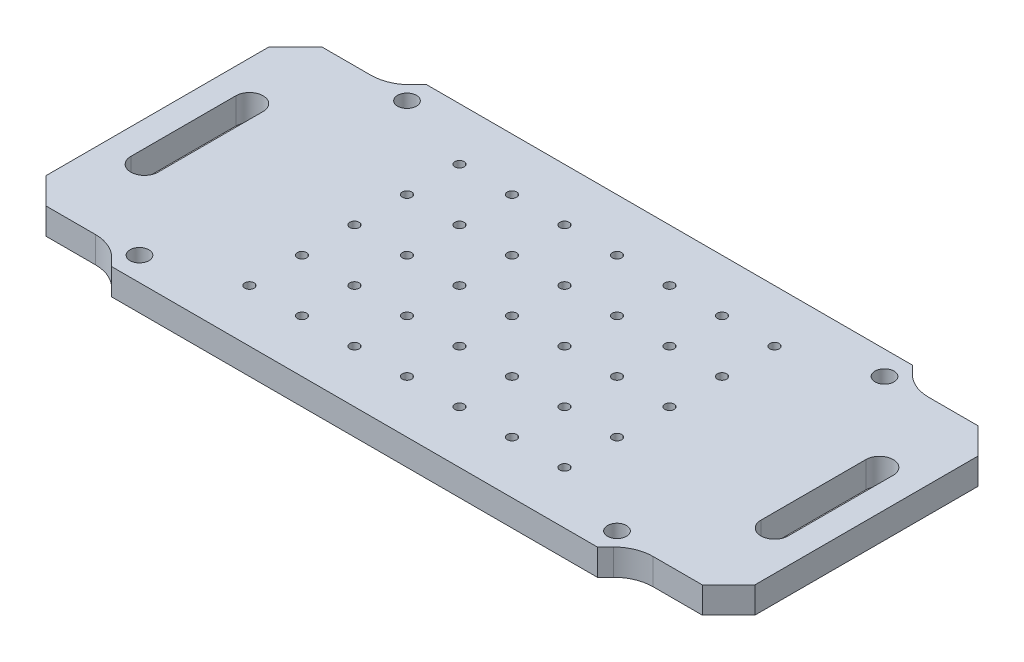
ISO-10303-21;
HEADER;
FILE_DESCRIPTION(('STEP AP214'),'2;1');
FILE_NAME('part.step','',(''),(''),'','','');
FILE_SCHEMA(('AUTOMOTIVE_DESIGN { 1 0 10303 214 1 1 1 1 }'));
ENDSEC;
DATA;
#1=APPLICATION_CONTEXT('core data for automotive mechanical design processes');
#2=APPLICATION_PROTOCOL_DEFINITION('international standard','automotive_design',2000,#1);
#3=PRODUCT_CONTEXT('',#1,'mechanical');
#4=PRODUCT('Part','Part','',(#3));
#5=PRODUCT_RELATED_PRODUCT_CATEGORY('part','',(#4));
#6=PRODUCT_DEFINITION_FORMATION('','',#4);
#7=PRODUCT_DEFINITION_CONTEXT('part definition',#1,'design');
#8=PRODUCT_DEFINITION('design','',#6,#7);
#9=PRODUCT_DEFINITION_SHAPE('','',#8);
#10=(LENGTH_UNIT() NAMED_UNIT(*) SI_UNIT(.MILLI.,.METRE.));
#11=(NAMED_UNIT(*) PLANE_ANGLE_UNIT() SI_UNIT($,.RADIAN.));
#12=(NAMED_UNIT(*) SI_UNIT($,.STERADIAN.) SOLID_ANGLE_UNIT());
#13=UNCERTAINTY_MEASURE_WITH_UNIT(LENGTH_MEASURE(1.E-05),#10,'distance_accuracy_value','');
#14=(GEOMETRIC_REPRESENTATION_CONTEXT(3) GLOBAL_UNCERTAINTY_ASSIGNED_CONTEXT((#13)) GLOBAL_UNIT_ASSIGNED_CONTEXT((#10,
#11,#12)) REPRESENTATION_CONTEXT('',''));
#15=CARTESIAN_POINT('',(0.,0.,0.));
#16=DIRECTION('',(0.,0.,1.));
#17=DIRECTION('',(1.,0.,0.));
#18=AXIS2_PLACEMENT_3D('',#15,#16,#17);
#19=CARTESIAN_POINT('',(-63.5,3.175,-38.1));
#20=DIRECTION('',(0.,0.,1.));
#21=DIRECTION('',(1.,0.,0.));
#22=AXIS2_PLACEMENT_3D('',#19,#20,#21);
#23=PLANE('',#22);
#24=DIRECTION('',(-1.,0.,0.));
#25=VECTOR('',#24,1.);
#26=CARTESIAN_POINT('',(-63.5,-3.175,-38.1));
#27=LINE('',#26,#25);
#28=CARTESIAN_POINT('',(58.7375,-3.175,-38.1));
#29=VERTEX_POINT('',#28);
#30=CARTESIAN_POINT('',(-58.7375,-3.175,-38.1));
#31=VERTEX_POINT('',#30);
#32=EDGE_CURVE('E702',#29,#31,#27,.T.);
#33=ORIENTED_EDGE('',*,*,#32,.T.);
#34=DIRECTION('',(0.,1.,0.));
#35=VECTOR('',#34,1.);
#36=CARTESIAN_POINT('',(-58.7375,3.175,-38.1));
#37=LINE('',#36,#35);
#38=CARTESIAN_POINT('',(-58.7375,3.175,-38.1));
#39=VERTEX_POINT('',#38);
#40=EDGE_CURVE('E727',#31,#39,#37,.T.);
#41=ORIENTED_EDGE('',*,*,#40,.T.);
#42=DIRECTION('',(-1.,0.,0.));
#43=VECTOR('',#42,1.);
#44=CARTESIAN_POINT('',(-63.5,3.175,-38.1));
#45=LINE('',#44,#43);
#46=CARTESIAN_POINT('',(58.7375,3.175,-38.1));
#47=VERTEX_POINT('',#46);
#48=EDGE_CURVE('E703',#47,#39,#45,.T.);
#49=ORIENTED_EDGE('',*,*,#48,.F.);
#50=DIRECTION('',(0.,-1.,0.));
#51=VECTOR('',#50,1.);
#52=CARTESIAN_POINT('',(58.7375,3.175,-38.1));
#53=LINE('',#52,#51);
#54=EDGE_CURVE('E724',#47,#29,#53,.T.);
#55=ORIENTED_EDGE('',*,*,#54,.T.);
#56=EDGE_LOOP('',(#33,#41,#49,#55));
#57=FACE_BOUND('',#56,.T.);
#58=ADVANCED_FACE('F36',(#57),#23,.F.);
#59=CARTESIAN_POINT('',(-63.5,3.175,38.1));
#60=DIRECTION('',(0.,0.,-1.));
#61=DIRECTION('',(-1.,0.,0.));
#62=AXIS2_PLACEMENT_3D('',#59,#60,#61);
#63=PLANE('',#62);
#64=DIRECTION('',(1.,0.,0.));
#65=VECTOR('',#64,1.);
#66=CARTESIAN_POINT('',(-63.5,-3.175,38.1));
#67=LINE('',#66,#65);
#68=CARTESIAN_POINT('',(-58.7375,-3.175,38.1));
#69=VERTEX_POINT('',#68);
#70=CARTESIAN_POINT('',(58.7375,-3.175,38.1));
#71=VERTEX_POINT('',#70);
#72=EDGE_CURVE('E707',#69,#71,#67,.T.);
#73=ORIENTED_EDGE('',*,*,#72,.T.);
#74=DIRECTION('',(0.,1.,0.));
#75=VECTOR('',#74,1.);
#76=CARTESIAN_POINT('',(58.7375,3.175,38.1));
#77=LINE('',#76,#75);
#78=CARTESIAN_POINT('',(58.7375,3.175,38.1));
#79=VERTEX_POINT('',#78);
#80=EDGE_CURVE('E741',#71,#79,#77,.T.);
#81=ORIENTED_EDGE('',*,*,#80,.T.);
#82=DIRECTION('',(1.,0.,0.));
#83=VECTOR('',#82,1.);
#84=CARTESIAN_POINT('',(-63.5,3.175,38.1));
#85=LINE('',#84,#83);
#86=CARTESIAN_POINT('',(-58.7375,3.175,38.1));
#87=VERTEX_POINT('',#86);
#88=EDGE_CURVE('E706',#87,#79,#85,.T.);
#89=ORIENTED_EDGE('',*,*,#88,.F.);
#90=DIRECTION('',(0.,-1.,0.));
#91=VECTOR('',#90,1.);
#92=CARTESIAN_POINT('',(-58.7375,3.175,38.1));
#93=LINE('',#92,#91);
#94=EDGE_CURVE('E738',#87,#69,#93,.T.);
#95=ORIENTED_EDGE('',*,*,#94,.T.);
#96=EDGE_LOOP('',(#73,#81,#89,#95));
#97=FACE_BOUND('',#96,.T.);
#98=ADVANCED_FACE('F794',(#97),#63,.F.);
#99=CARTESIAN_POINT('',(0.,3.175,0.));
#100=DIRECTION('',(0.,-1.,0.));
#101=DIRECTION('',(0.,0.,-1.));
#102=AXIS2_PLACEMENT_3D('',#99,#100,#101);
#103=PLANE('',#102);
#104=CARTESIAN_POINT('',(-38.1000000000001,3.175,-25.3999999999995));
#105=DIRECTION('',(0.,1.,0.));
#106=DIRECTION('',(0.,0.,1.));
#107=AXIS2_PLACEMENT_3D('',#104,#105,#106);
#108=CIRCLE('',#107,1.1303);
#109=CARTESIAN_POINT('',(-38.1000000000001,3.175,-24.2696999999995));
#110=VERTEX_POINT('',#109);
#111=EDGE_CURVE('E334',#110,#110,#108,.T.);
#112=ORIENTED_EDGE('',*,*,#111,.F.);
#113=EDGE_LOOP('',(#112));
#114=FACE_BOUND('',#113,.T.);
#115=CARTESIAN_POINT('',(-25.4000000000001,3.175,-25.3999999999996));
#116=DIRECTION('',(0.,1.,0.));
#117=DIRECTION('',(0.,0.,1.));
#118=AXIS2_PLACEMENT_3D('',#115,#116,#117);
#119=CIRCLE('',#118,1.1303);
#120=CARTESIAN_POINT('',(-25.4000000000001,3.175,-24.2696999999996));
#121=VERTEX_POINT('',#120);
#122=EDGE_CURVE('E333',#121,#121,#119,.T.);
#123=ORIENTED_EDGE('',*,*,#122,.F.);
#124=EDGE_LOOP('',(#123));
#125=FACE_BOUND('',#124,.T.);
#126=CARTESIAN_POINT('',(-25.4,3.175,-12.6999999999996));
#127=DIRECTION('',(0.,1.,0.));
#128=DIRECTION('',(0.,0.,1.));
#129=AXIS2_PLACEMENT_3D('',#126,#127,#128);
#130=CIRCLE('',#129,1.1303);
#131=CARTESIAN_POINT('',(-25.4,3.175,-11.5696999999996));
#132=VERTEX_POINT('',#131);
#133=EDGE_CURVE('E344',#132,#132,#130,.T.);
#134=ORIENTED_EDGE('',*,*,#133,.F.);
#135=EDGE_LOOP('',(#134));
#136=FACE_BOUND('',#135,.T.);
#137=CARTESIAN_POINT('',(-38.1,3.175,-12.6999999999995));
#138=DIRECTION('',(0.,1.,0.));
#139=DIRECTION('',(0.,0.,1.));
#140=AXIS2_PLACEMENT_3D('',#137,#138,#139);
#141=CIRCLE('',#140,1.1303);
#142=CARTESIAN_POINT('',(-38.1,3.175,-11.5696999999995));
#143=VERTEX_POINT('',#142);
#144=EDGE_CURVE('E350',#143,#143,#141,.T.);
#145=ORIENTED_EDGE('',*,*,#144,.F.);
#146=EDGE_LOOP('',(#145));
#147=FACE_BOUND('',#146,.T.);
#148=CARTESIAN_POINT('',(-38.1,3.175,5.30825383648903E-13));
#149=DIRECTION('',(0.,1.,0.));
#150=DIRECTION('',(0.,0.,1.));
#151=AXIS2_PLACEMENT_3D('',#148,#149,#150);
#152=CIRCLE('',#151,1.1303);
#153=CARTESIAN_POINT('',(-38.1,3.175,1.13030000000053));
#154=VERTEX_POINT('',#153);
#155=EDGE_CURVE('E356',#154,#154,#152,.T.);
#156=ORIENTED_EDGE('',*,*,#155,.F.);
#157=EDGE_LOOP('',(#156));
#158=FACE_BOUND('',#157,.T.);
#159=CARTESIAN_POINT('',(-25.4,3.175,3.53883589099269E-13));
#160=DIRECTION('',(0.,1.,0.));
#161=DIRECTION('',(0.,0.,1.));
#162=AXIS2_PLACEMENT_3D('',#159,#160,#161);
#163=CIRCLE('',#162,1.1303);
#164=CARTESIAN_POINT('',(-25.4,3.175,1.13030000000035));
#165=VERTEX_POINT('',#164);
#166=EDGE_CURVE('E362',#165,#165,#163,.T.);
#167=ORIENTED_EDGE('',*,*,#166,.F.);
#168=EDGE_LOOP('',(#167));
#169=FACE_BOUND('',#168,.T.);
#170=CARTESIAN_POINT('',(-25.3999999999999,3.175,12.7000000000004));
#171=DIRECTION('',(0.,1.,0.));
#172=DIRECTION('',(0.,0.,1.));
#173=AXIS2_PLACEMENT_3D('',#170,#171,#172);
#174=CIRCLE('',#173,1.1303);
#175=CARTESIAN_POINT('',(-25.3999999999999,3.175,13.8303000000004));
#176=VERTEX_POINT('',#175);
#177=EDGE_CURVE('E368',#176,#176,#174,.T.);
#178=ORIENTED_EDGE('',*,*,#177,.F.);
#179=EDGE_LOOP('',(#178));
#180=FACE_BOUND('',#179,.T.);
#181=CARTESIAN_POINT('',(-38.0999999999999,3.175,12.7000000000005));
#182=DIRECTION('',(0.,1.,0.));
#183=DIRECTION('',(0.,0.,1.));
#184=AXIS2_PLACEMENT_3D('',#181,#182,#183);
#185=CIRCLE('',#184,1.1303);
#186=CARTESIAN_POINT('',(-38.0999999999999,3.175,13.8303000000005));
#187=VERTEX_POINT('',#186);
#188=EDGE_CURVE('E374',#187,#187,#185,.T.);
#189=ORIENTED_EDGE('',*,*,#188,.F.);
#190=EDGE_LOOP('',(#189));
#191=FACE_BOUND('',#190,.T.);
#192=CARTESIAN_POINT('',(-38.0999999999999,3.175,25.4000000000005));
#193=DIRECTION('',(0.,1.,0.));
#194=DIRECTION('',(0.,0.,1.));
#195=AXIS2_PLACEMENT_3D('',#192,#193,#194);
#196=CIRCLE('',#195,1.1303);
#197=CARTESIAN_POINT('',(-38.0999999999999,3.175,26.5303000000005));
#198=VERTEX_POINT('',#197);
#199=EDGE_CURVE('E380',#198,#198,#196,.T.);
#200=ORIENTED_EDGE('',*,*,#199,.F.);
#201=EDGE_LOOP('',(#200));
#202=FACE_BOUND('',#201,.T.);
#203=CARTESIAN_POINT('',(-25.3999999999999,3.175,25.4000000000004));
#204=DIRECTION('',(0.,1.,0.));
#205=DIRECTION('',(0.,0.,1.));
#206=AXIS2_PLACEMENT_3D('',#203,#204,#205);
#207=CIRCLE('',#206,1.1303);
#208=CARTESIAN_POINT('',(-25.3999999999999,3.175,26.5303000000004));
#209=VERTEX_POINT('',#208);
#210=EDGE_CURVE('E386',#209,#209,#207,.T.);
#211=ORIENTED_EDGE('',*,*,#210,.F.);
#212=EDGE_LOOP('',(#211));
#213=FACE_BOUND('',#212,.T.);
#214=CARTESIAN_POINT('',(-12.6999999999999,3.175,25.4000000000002));
#215=DIRECTION('',(0.,1.,0.));
#216=DIRECTION('',(0.,0.,1.));
#217=AXIS2_PLACEMENT_3D('',#214,#215,#216);
#218=CIRCLE('',#217,1.1303);
#219=CARTESIAN_POINT('',(-12.6999999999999,3.175,26.5303000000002));
#220=VERTEX_POINT('',#219);
#221=EDGE_CURVE('E392',#220,#220,#218,.T.);
#222=ORIENTED_EDGE('',*,*,#221,.F.);
#223=EDGE_LOOP('',(#222));
#224=FACE_BOUND('',#223,.T.);
#225=CARTESIAN_POINT('',(-12.7,3.175,12.7000000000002));
#226=DIRECTION('',(0.,1.,0.));
#227=DIRECTION('',(0.,0.,1.));
#228=AXIS2_PLACEMENT_3D('',#225,#226,#227);
#229=CIRCLE('',#228,1.1303);
#230=CARTESIAN_POINT('',(-12.7,3.175,13.8303000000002));
#231=VERTEX_POINT('',#230);
#232=EDGE_CURVE('E398',#231,#231,#229,.T.);
#233=ORIENTED_EDGE('',*,*,#232,.F.);
#234=EDGE_LOOP('',(#233));
#235=FACE_BOUND('',#234,.T.);
#236=CARTESIAN_POINT('',(-12.7,3.175,1.76941794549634E-13));
#237=DIRECTION('',(0.,1.,0.));
#238=DIRECTION('',(0.,0.,1.));
#239=AXIS2_PLACEMENT_3D('',#236,#237,#238);
#240=CIRCLE('',#239,1.1303);
#241=CARTESIAN_POINT('',(-12.7,3.175,1.13030000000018));
#242=VERTEX_POINT('',#241);
#243=EDGE_CURVE('E404',#242,#242,#240,.T.);
#244=ORIENTED_EDGE('',*,*,#243,.F.);
#245=EDGE_LOOP('',(#244));
#246=FACE_BOUND('',#245,.T.);
#247=CARTESIAN_POINT('',(-12.7,3.175,-12.6999999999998));
#248=DIRECTION('',(0.,1.,0.));
#249=DIRECTION('',(0.,0.,1.));
#250=AXIS2_PLACEMENT_3D('',#247,#248,#249);
#251=CIRCLE('',#250,1.1303);
#252=CARTESIAN_POINT('',(-12.7,3.175,-11.5696999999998));
#253=VERTEX_POINT('',#252);
#254=EDGE_CURVE('E410',#253,#253,#251,.T.);
#255=ORIENTED_EDGE('',*,*,#254,.F.);
#256=EDGE_LOOP('',(#255));
#257=FACE_BOUND('',#256,.T.);
#258=CARTESIAN_POINT('',(-12.7000000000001,3.175,-25.3999999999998));
#259=DIRECTION('',(0.,1.,0.));
#260=DIRECTION('',(0.,0.,1.));
#261=AXIS2_PLACEMENT_3D('',#258,#259,#260);
#262=CIRCLE('',#261,1.1303);
#263=CARTESIAN_POINT('',(-12.7000000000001,3.175,-24.2696999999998));
#264=VERTEX_POINT('',#263);
#265=EDGE_CURVE('E416',#264,#264,#262,.T.);
#266=ORIENTED_EDGE('',*,*,#265,.F.);
#267=EDGE_LOOP('',(#266));
#268=FACE_BOUND('',#267,.T.);
#269=CARTESIAN_POINT('',(0.,3.175,-25.4));
#270=DIRECTION('',(0.,1.,0.));
#271=DIRECTION('',(0.,0.,1.));
#272=AXIS2_PLACEMENT_3D('',#269,#270,#271);
#273=CIRCLE('',#272,1.1303);
#274=CARTESIAN_POINT('',(0.,3.175,-24.2697));
#275=VERTEX_POINT('',#274);
#276=EDGE_CURVE('E422',#275,#275,#273,.T.);
#277=ORIENTED_EDGE('',*,*,#276,.F.);
#278=EDGE_LOOP('',(#277));
#279=FACE_BOUND('',#278,.T.);
#280=CARTESIAN_POINT('',(0.,3.175,-12.7));
#281=DIRECTION('',(0.,1.,0.));
#282=DIRECTION('',(0.,0.,1.));
#283=AXIS2_PLACEMENT_3D('',#280,#281,#282);
#284=CIRCLE('',#283,1.1303);
#285=CARTESIAN_POINT('',(0.,3.175,-11.5697));
#286=VERTEX_POINT('',#285);
#287=EDGE_CURVE('E428',#286,#286,#284,.T.);
#288=ORIENTED_EDGE('',*,*,#287,.F.);
#289=EDGE_LOOP('',(#288));
#290=FACE_BOUND('',#289,.T.);
#291=CARTESIAN_POINT('',(0.,3.175,12.7));
#292=DIRECTION('',(0.,1.,0.));
#293=DIRECTION('',(0.,0.,1.));
#294=AXIS2_PLACEMENT_3D('',#291,#292,#293);
#295=CIRCLE('',#294,1.1303);
#296=CARTESIAN_POINT('',(0.,3.175,13.8303));
#297=VERTEX_POINT('',#296);
#298=EDGE_CURVE('E434',#297,#297,#295,.T.);
#299=ORIENTED_EDGE('',*,*,#298,.F.);
#300=EDGE_LOOP('',(#299));
#301=FACE_BOUND('',#300,.T.);
#302=CARTESIAN_POINT('',(0.,3.175,0.));
#303=DIRECTION('',(0.,1.,0.));
#304=DIRECTION('',(0.,0.,1.));
#305=AXIS2_PLACEMENT_3D('',#302,#303,#304);
#306=CIRCLE('',#305,1.1303);
#307=CARTESIAN_POINT('',(0.,3.175,1.1303));
#308=VERTEX_POINT('',#307);
#309=EDGE_CURVE('E440',#308,#308,#306,.T.);
#310=ORIENTED_EDGE('',*,*,#309,.F.);
#311=EDGE_LOOP('',(#310));
#312=FACE_BOUND('',#311,.T.);
#313=CARTESIAN_POINT('',(0.,3.175,25.4));
#314=DIRECTION('',(0.,1.,0.));
#315=DIRECTION('',(0.,0.,1.));
#316=AXIS2_PLACEMENT_3D('',#313,#314,#315);
#317=CIRCLE('',#316,1.1303);
#318=CARTESIAN_POINT('',(0.,3.175,26.5303));
#319=VERTEX_POINT('',#318);
#320=EDGE_CURVE('E446',#319,#319,#317,.T.);
#321=ORIENTED_EDGE('',*,*,#320,.F.);
#322=EDGE_LOOP('',(#321));
#323=FACE_BOUND('',#322,.T.);
#324=CARTESIAN_POINT('',(12.7000000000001,3.175,25.3999999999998));
#325=DIRECTION('',(0.,1.,0.));
#326=DIRECTION('',(0.,0.,1.));
#327=AXIS2_PLACEMENT_3D('',#324,#325,#326);
#328=CIRCLE('',#327,1.1303);
#329=CARTESIAN_POINT('',(12.7000000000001,3.175,26.5302999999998));
#330=VERTEX_POINT('',#329);
#331=EDGE_CURVE('E452',#330,#330,#328,.T.);
#332=ORIENTED_EDGE('',*,*,#331,.F.);
#333=EDGE_LOOP('',(#332));
#334=FACE_BOUND('',#333,.T.);
#335=CARTESIAN_POINT('',(12.7000000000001,3.175,12.6999999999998));
#336=DIRECTION('',(0.,1.,0.));
#337=DIRECTION('',(0.,0.,1.));
#338=AXIS2_PLACEMENT_3D('',#335,#336,#337);
#339=CIRCLE('',#338,1.1303);
#340=CARTESIAN_POINT('',(12.7000000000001,3.175,13.8302999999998));
#341=VERTEX_POINT('',#340);
#342=EDGE_CURVE('E458',#341,#341,#339,.T.);
#343=ORIENTED_EDGE('',*,*,#342,.F.);
#344=EDGE_LOOP('',(#343));
#345=FACE_BOUND('',#344,.T.);
#346=CARTESIAN_POINT('',(12.7,3.175,-1.76941794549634E-13));
#347=DIRECTION('',(0.,1.,0.));
#348=DIRECTION('',(0.,0.,1.));
#349=AXIS2_PLACEMENT_3D('',#346,#347,#348);
#350=CIRCLE('',#349,1.1303);
#351=CARTESIAN_POINT('',(12.7,3.175,1.13029999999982));
#352=VERTEX_POINT('',#351);
#353=EDGE_CURVE('E464',#352,#352,#350,.T.);
#354=ORIENTED_EDGE('',*,*,#353,.F.);
#355=EDGE_LOOP('',(#354));
#356=FACE_BOUND('',#355,.T.);
#357=CARTESIAN_POINT('',(12.7,3.175,-12.7000000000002));
#358=DIRECTION('',(0.,1.,0.));
#359=DIRECTION('',(0.,0.,1.));
#360=AXIS2_PLACEMENT_3D('',#357,#358,#359);
#361=CIRCLE('',#360,1.1303);
#362=CARTESIAN_POINT('',(12.7,3.175,-11.5697000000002));
#363=VERTEX_POINT('',#362);
#364=EDGE_CURVE('E470',#363,#363,#361,.T.);
#365=ORIENTED_EDGE('',*,*,#364,.F.);
#366=EDGE_LOOP('',(#365));
#367=FACE_BOUND('',#366,.T.);
#368=CARTESIAN_POINT('',(12.6999999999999,3.175,-25.4000000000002));
#369=DIRECTION('',(0.,1.,0.));
#370=DIRECTION('',(0.,0.,1.));
#371=AXIS2_PLACEMENT_3D('',#368,#369,#370);
#372=CIRCLE('',#371,1.1303);
#373=CARTESIAN_POINT('',(12.6999999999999,3.175,-24.2697000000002));
#374=VERTEX_POINT('',#373);
#375=EDGE_CURVE('E476',#374,#374,#372,.T.);
#376=ORIENTED_EDGE('',*,*,#375,.F.);
#377=EDGE_LOOP('',(#376));
#378=FACE_BOUND('',#377,.T.);
#379=CARTESIAN_POINT('',(25.3999999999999,3.175,-25.4000000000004));
#380=DIRECTION('',(0.,1.,0.));
#381=DIRECTION('',(0.,0.,1.));
#382=AXIS2_PLACEMENT_3D('',#379,#380,#381);
#383=CIRCLE('',#382,1.1303);
#384=CARTESIAN_POINT('',(25.3999999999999,3.175,-24.2697000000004));
#385=VERTEX_POINT('',#384);
#386=EDGE_CURVE('E482',#385,#385,#383,.T.);
#387=ORIENTED_EDGE('',*,*,#386,.F.);
#388=EDGE_LOOP('',(#387));
#389=FACE_BOUND('',#388,.T.);
#390=CARTESIAN_POINT('',(25.4,3.175,-12.7000000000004));
#391=DIRECTION('',(0.,1.,0.));
#392=DIRECTION('',(0.,0.,1.));
#393=AXIS2_PLACEMENT_3D('',#390,#391,#392);
#394=CIRCLE('',#393,1.1303);
#395=CARTESIAN_POINT('',(25.4,3.175,-11.5697000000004));
#396=VERTEX_POINT('',#395);
#397=EDGE_CURVE('E488',#396,#396,#394,.T.);
#398=ORIENTED_EDGE('',*,*,#397,.F.);
#399=EDGE_LOOP('',(#398));
#400=FACE_BOUND('',#399,.T.);
#401=CARTESIAN_POINT('',(25.4,3.175,-3.57353036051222E-13));
#402=DIRECTION('',(0.,1.,0.));
#403=DIRECTION('',(0.,0.,1.));
#404=AXIS2_PLACEMENT_3D('',#401,#402,#403);
#405=CIRCLE('',#404,1.1303);
#406=CARTESIAN_POINT('',(25.4,3.175,1.13029999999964));
#407=VERTEX_POINT('',#406);
#408=EDGE_CURVE('E494',#407,#407,#405,.T.);
#409=ORIENTED_EDGE('',*,*,#408,.F.);
#410=EDGE_LOOP('',(#409));
#411=FACE_BOUND('',#410,.T.);
#412=CARTESIAN_POINT('',(25.4000000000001,3.175,12.6999999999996));
#413=DIRECTION('',(0.,1.,0.));
#414=DIRECTION('',(0.,0.,1.));
#415=AXIS2_PLACEMENT_3D('',#412,#413,#414);
#416=CIRCLE('',#415,1.1303);
#417=CARTESIAN_POINT('',(25.4000000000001,3.175,13.8302999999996));
#418=VERTEX_POINT('',#417);
#419=EDGE_CURVE('E500',#418,#418,#416,.T.);
#420=ORIENTED_EDGE('',*,*,#419,.F.);
#421=EDGE_LOOP('',(#420));
#422=FACE_BOUND('',#421,.T.);
#423=CARTESIAN_POINT('',(25.4000000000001,3.175,25.3999999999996));
#424=DIRECTION('',(0.,1.,0.));
#425=DIRECTION('',(0.,0.,1.));
#426=AXIS2_PLACEMENT_3D('',#423,#424,#425);
#427=CIRCLE('',#426,1.1303);
#428=CARTESIAN_POINT('',(25.4000000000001,3.175,26.5302999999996));
#429=VERTEX_POINT('',#428);
#430=EDGE_CURVE('E506',#429,#429,#427,.T.);
#431=ORIENTED_EDGE('',*,*,#430,.F.);
#432=EDGE_LOOP('',(#431));
#433=FACE_BOUND('',#432,.T.);
#434=CARTESIAN_POINT('',(38.1000000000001,3.175,25.3999999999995));
#435=DIRECTION('',(0.,1.,0.));
#436=DIRECTION('',(0.,0.,1.));
#437=AXIS2_PLACEMENT_3D('',#434,#435,#436);
#438=CIRCLE('',#437,1.1303);
#439=CARTESIAN_POINT('',(38.1000000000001,3.175,26.5302999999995));
#440=VERTEX_POINT('',#439);
#441=EDGE_CURVE('E512',#440,#440,#438,.T.);
#442=ORIENTED_EDGE('',*,*,#441,.F.);
#443=EDGE_LOOP('',(#442));
#444=FACE_BOUND('',#443,.T.);
#445=CARTESIAN_POINT('',(38.1,3.175,12.6999999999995));
#446=DIRECTION('',(0.,1.,0.));
#447=DIRECTION('',(0.,0.,1.));
#448=AXIS2_PLACEMENT_3D('',#445,#446,#447);
#449=CIRCLE('',#448,1.1303);
#450=CARTESIAN_POINT('',(38.1,3.175,13.8302999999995));
#451=VERTEX_POINT('',#450);
#452=EDGE_CURVE('E518',#451,#451,#449,.T.);
#453=ORIENTED_EDGE('',*,*,#452,.F.);
#454=EDGE_LOOP('',(#453));
#455=FACE_BOUND('',#454,.T.);
#456=CARTESIAN_POINT('',(38.1,3.175,-5.34294830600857E-13));
#457=DIRECTION('',(0.,1.,0.));
#458=DIRECTION('',(0.,0.,1.));
#459=AXIS2_PLACEMENT_3D('',#456,#457,#458);
#460=CIRCLE('',#459,1.1303);
#461=CARTESIAN_POINT('',(38.1,3.175,1.13029999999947));
#462=VERTEX_POINT('',#461);
#463=EDGE_CURVE('E524',#462,#462,#460,.T.);
#464=ORIENTED_EDGE('',*,*,#463,.F.);
#465=EDGE_LOOP('',(#464));
#466=FACE_BOUND('',#465,.T.);
#467=CARTESIAN_POINT('',(38.1,3.175,-12.7000000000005));
#468=DIRECTION('',(0.,1.,0.));
#469=DIRECTION('',(0.,0.,1.));
#470=AXIS2_PLACEMENT_3D('',#467,#468,#469);
#471=CIRCLE('',#470,1.1303);
#472=CARTESIAN_POINT('',(38.1,3.175,-11.5697000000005));
#473=VERTEX_POINT('',#472);
#474=EDGE_CURVE('E530',#473,#473,#471,.T.);
#475=ORIENTED_EDGE('',*,*,#474,.F.);
#476=EDGE_LOOP('',(#475));
#477=FACE_BOUND('',#476,.T.);
#478=CARTESIAN_POINT('',(38.0999999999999,3.175,-25.4000000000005));
#479=DIRECTION('',(0.,1.,0.));
#480=DIRECTION('',(0.,0.,1.));
#481=AXIS2_PLACEMENT_3D('',#478,#479,#480);
#482=CIRCLE('',#481,1.1303);
#483=CARTESIAN_POINT('',(38.0999999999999,3.175,-24.2697000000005));
#484=VERTEX_POINT('',#483);
#485=EDGE_CURVE('E536',#484,#484,#482,.T.);
#486=ORIENTED_EDGE('',*,*,#485,.F.);
#487=EDGE_LOOP('',(#486));
#488=FACE_BOUND('',#487,.T.);
#489=CARTESIAN_POINT('',(-57.7511539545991,3.175,32.3511539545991));
#490=DIRECTION('',(0.,-1.,0.));
#491=DIRECTION('',(0.,0.,-1.));
#492=AXIS2_PLACEMENT_3D('',#489,#490,#491);
#493=CIRCLE('',#492,2.28599999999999);
#494=CARTESIAN_POINT('',(-57.7511539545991,3.175,30.0651539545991));
#495=VERTEX_POINT('',#494);
#496=EDGE_CURVE('E681',#495,#495,#493,.F.);
#497=ORIENTED_EDGE('',*,*,#496,.F.);
#498=EDGE_LOOP('',(#497));
#499=FACE_BOUND('',#498,.T.);
#500=CARTESIAN_POINT('',(57.7511539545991,3.175,32.3511539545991));
#501=DIRECTION('',(0.,-1.,0.));
#502=DIRECTION('',(0.,0.,-1.));
#503=AXIS2_PLACEMENT_3D('',#500,#501,#502);
#504=CIRCLE('',#503,2.28599999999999);
#505=CARTESIAN_POINT('',(57.7511539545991,3.175,30.0651539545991));
#506=VERTEX_POINT('',#505);
#507=EDGE_CURVE('E687',#506,#506,#504,.T.);
#508=ORIENTED_EDGE('',*,*,#507,.T.);
#509=EDGE_LOOP('',(#508));
#510=FACE_BOUND('',#509,.T.);
#511=CARTESIAN_POINT('',(57.7511539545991,3.175,-32.3511539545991));
#512=DIRECTION('',(0.,-1.,0.));
#513=DIRECTION('',(0.,0.,-1.));
#514=AXIS2_PLACEMENT_3D('',#511,#512,#513);
#515=CIRCLE('',#514,2.28599999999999);
#516=CARTESIAN_POINT('',(57.7511539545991,3.175,-34.6371539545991));
#517=VERTEX_POINT('',#516);
#518=EDGE_CURVE('E693',#517,#517,#515,.F.);
#519=ORIENTED_EDGE('',*,*,#518,.F.);
#520=EDGE_LOOP('',(#519));
#521=FACE_BOUND('',#520,.T.);
#522=CARTESIAN_POINT('',(-57.7511539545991,3.175,-32.3511539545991));
#523=DIRECTION('',(0.,-1.,0.));
#524=DIRECTION('',(0.,0.,-1.));
#525=AXIS2_PLACEMENT_3D('',#522,#523,#524);
#526=CIRCLE('',#525,2.28599999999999);
#527=CARTESIAN_POINT('',(-57.7511539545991,3.175,-34.6371539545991));
#528=VERTEX_POINT('',#527);
#529=EDGE_CURVE('E699',#528,#528,#526,.T.);
#530=ORIENTED_EDGE('',*,*,#529,.T.);
#531=EDGE_LOOP('',(#530));
#532=FACE_BOUND('',#531,.T.);
#533=ORIENTED_EDGE('',*,*,#48,.T.);
#534=DIRECTION('',(0.707106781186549,0.,-0.707106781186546));
#535=VECTOR('',#534,1.);
#536=CARTESIAN_POINT('',(-63.5,3.175,-33.3375));
#537=LINE('',#536,#535);
#538=CARTESIAN_POINT('',(-60.7101920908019,3.175,-36.1273079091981));
#539=VERTEX_POINT('',#538);
#540=EDGE_CURVE('E736',#39,#539,#537,.F.);
#541=ORIENTED_EDGE('',*,*,#540,.T.);
#542=CARTESIAN_POINT('',(-67.4453841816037,3.175,-42.8625));
#543=DIRECTION('',(0.,-1.,0.));
#544=DIRECTION('',(0.,0.,-1.));
#545=AXIS2_PLACEMENT_3D('',#542,#543,#544);
#546=CIRCLE('',#545,9.525);
#547=CARTESIAN_POINT('',(-67.4453841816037,3.175,-33.3375));
#548=VERTEX_POINT('',#547);
#549=EDGE_CURVE('E11',#539,#548,#546,.T.);
#550=ORIENTED_EDGE('',*,*,#549,.T.);
#551=DIRECTION('',(-1.,0.,0.));
#552=VECTOR('',#551,1.);
#553=CARTESIAN_POINT('',(0.,3.175,-33.3375));
#554=LINE('',#553,#552);
#555=CARTESIAN_POINT('',(-79.375,3.175,-33.3375));
#556=VERTEX_POINT('',#555);
#557=EDGE_CURVE('E653',#548,#556,#554,.T.);
#558=ORIENTED_EDGE('',*,*,#557,.T.);
#559=DIRECTION('',(-0.707106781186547,0.,0.707106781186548));
#560=VECTOR('',#559,1.);
#561=CARTESIAN_POINT('',(-56.35625,3.175,-56.35625));
#562=LINE('',#561,#560);
#563=CARTESIAN_POINT('',(-85.725,3.175,-26.9875));
#564=VERTEX_POINT('',#563);
#565=EDGE_CURVE('E655',#556,#564,#562,.T.);
#566=ORIENTED_EDGE('',*,*,#565,.T.);
#567=DIRECTION('',(0.,0.,1.));
#568=VECTOR('',#567,1.);
#569=CARTESIAN_POINT('',(-85.725,3.175,0.));
#570=LINE('',#569,#568);
#571=CARTESIAN_POINT('',(-85.725,3.175,26.9875));
#572=VERTEX_POINT('',#571);
#573=EDGE_CURVE('E644',#564,#572,#570,.T.);
#574=ORIENTED_EDGE('',*,*,#573,.T.);
#575=DIRECTION('',(0.707106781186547,0.,0.707106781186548));
#576=VECTOR('',#575,1.);
#577=CARTESIAN_POINT('',(-56.35625,3.175,56.35625));
#578=LINE('',#577,#576);
#579=CARTESIAN_POINT('',(-79.375,3.175,33.3375));
#580=VERTEX_POINT('',#579);
#581=EDGE_CURVE('E647',#572,#580,#578,.T.);
#582=ORIENTED_EDGE('',*,*,#581,.T.);
#583=DIRECTION('',(1.,0.,0.));
#584=VECTOR('',#583,1.);
#585=CARTESIAN_POINT('',(0.,3.175,33.3375));
#586=LINE('',#585,#584);
#587=CARTESIAN_POINT('',(-67.4453841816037,3.175,33.3375));
#588=VERTEX_POINT('',#587);
#589=EDGE_CURVE('E650',#580,#588,#586,.T.);
#590=ORIENTED_EDGE('',*,*,#589,.T.);
#591=CARTESIAN_POINT('',(-67.4453841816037,3.175,42.8625));
#592=DIRECTION('',(0.,-1.,0.));
#593=DIRECTION('',(0.,0.,-1.));
#594=AXIS2_PLACEMENT_3D('',#591,#592,#593);
#595=CIRCLE('',#594,9.525);
#596=CARTESIAN_POINT('',(-60.7101920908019,3.175,36.1273079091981));
#597=VERTEX_POINT('',#596);
#598=EDGE_CURVE('E770',#588,#597,#595,.T.);
#599=ORIENTED_EDGE('',*,*,#598,.T.);
#600=DIRECTION('',(-0.707106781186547,0.,-0.707106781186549));
#601=VECTOR('',#600,1.);
#602=CARTESIAN_POINT('',(-58.7375,3.175,38.1));
#603=LINE('',#602,#601);
#604=EDGE_CURVE('E729',#597,#87,#603,.F.);
#605=ORIENTED_EDGE('',*,*,#604,.T.);
#606=ORIENTED_EDGE('',*,*,#88,.T.);
#607=DIRECTION('',(-0.707106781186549,0.,0.707106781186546));
#608=VECTOR('',#607,1.);
#609=CARTESIAN_POINT('',(63.5,3.175,33.3375));
#610=LINE('',#609,#608);
#611=CARTESIAN_POINT('',(60.7101920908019,3.175,36.1273079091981));
#612=VERTEX_POINT('',#611);
#613=EDGE_CURVE('E731',#79,#612,#610,.F.);
#614=ORIENTED_EDGE('',*,*,#613,.T.);
#615=CARTESIAN_POINT('',(67.4453841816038,3.175,42.8625));
#616=DIRECTION('',(0.,-1.,0.));
#617=DIRECTION('',(0.,0.,-1.));
#618=AXIS2_PLACEMENT_3D('',#615,#616,#617);
#619=CIRCLE('',#618,9.525);
#620=CARTESIAN_POINT('',(67.4453841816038,3.175,33.3375));
#621=VERTEX_POINT('',#620);
#622=EDGE_CURVE('E768',#612,#621,#619,.T.);
#623=ORIENTED_EDGE('',*,*,#622,.T.);
#624=DIRECTION('',(-1.,0.,0.));
#625=VECTOR('',#624,1.);
#626=CARTESIAN_POINT('',(0.,3.175,33.3374999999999));
#627=LINE('',#626,#625);
#628=CARTESIAN_POINT('',(79.375,3.175,33.3375));
#629=VERTEX_POINT('',#628);
#630=EDGE_CURVE('E569',#629,#621,#627,.T.);
#631=ORIENTED_EDGE('',*,*,#630,.F.);
#632=DIRECTION('',(-0.707106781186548,0.,0.707106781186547));
#633=VECTOR('',#632,1.);
#634=CARTESIAN_POINT('',(56.35625,3.175,56.35625));
#635=LINE('',#634,#633);
#636=CARTESIAN_POINT('',(85.725,3.175,26.9875));
#637=VERTEX_POINT('',#636);
#638=EDGE_CURVE('E572',#637,#629,#635,.T.);
#639=ORIENTED_EDGE('',*,*,#638,.F.);
#640=DIRECTION('',(0.,0.,1.));
#641=VECTOR('',#640,1.);
#642=CARTESIAN_POINT('',(85.725,3.175,0.));
#643=LINE('',#642,#641);
#644=CARTESIAN_POINT('',(85.725,3.175,-26.9875));
#645=VERTEX_POINT('',#644);
#646=EDGE_CURVE('E575',#645,#637,#643,.T.);
#647=ORIENTED_EDGE('',*,*,#646,.F.);
#648=DIRECTION('',(0.707106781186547,0.,0.707106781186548));
#649=VECTOR('',#648,1.);
#650=CARTESIAN_POINT('',(56.3562500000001,3.175,-56.35625));
#651=LINE('',#650,#649);
#652=CARTESIAN_POINT('',(79.375,3.175,-33.3375));
#653=VERTEX_POINT('',#652);
#654=EDGE_CURVE('E564',#653,#645,#651,.T.);
#655=ORIENTED_EDGE('',*,*,#654,.F.);
#656=DIRECTION('',(1.,0.,0.));
#657=VECTOR('',#656,1.);
#658=CARTESIAN_POINT('',(0.,3.175,-33.3375));
#659=LINE('',#658,#657);
#660=CARTESIAN_POINT('',(67.4453841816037,3.175,-33.3375));
#661=VERTEX_POINT('',#660);
#662=EDGE_CURVE('E567',#661,#653,#659,.T.);
#663=ORIENTED_EDGE('',*,*,#662,.F.);
#664=CARTESIAN_POINT('',(67.4453841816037,3.175,-42.8625));
#665=DIRECTION('',(0.,-1.,0.));
#666=DIRECTION('',(0.,0.,-1.));
#667=AXIS2_PLACEMENT_3D('',#664,#665,#666);
#668=CIRCLE('',#667,9.525);
#669=CARTESIAN_POINT('',(60.7101920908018,3.175,-36.1273079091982));
#670=VERTEX_POINT('',#669);
#671=EDGE_CURVE('E762',#661,#670,#668,.T.);
#672=ORIENTED_EDGE('',*,*,#671,.T.);
#673=DIRECTION('',(0.707106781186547,0.,0.707106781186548));
#674=VECTOR('',#673,1.);
#675=CARTESIAN_POINT('',(58.7375,3.175,-38.1));
#676=LINE('',#675,#674);
#677=EDGE_CURVE('E734',#670,#47,#676,.F.);
#678=ORIENTED_EDGE('',*,*,#677,.T.);
#679=EDGE_LOOP('',(#533,#541,#550,#558,#566,#574,#582,#590,#599,#605,#606,#614,#623,#631,#639,
#647,#655,#663,#672,#678));
#680=FACE_BOUND('',#679,.T.);
#681=CARTESIAN_POINT('',(-76.2,3.175,12.7));
#682=DIRECTION('',(0.,1.,0.));
#683=DIRECTION('',(0.,0.,1.));
#684=AXIS2_PLACEMENT_3D('',#681,#682,#683);
#685=CIRCLE('',#684,3.302);
#686=CARTESIAN_POINT('',(-79.502,3.175,12.7));
#687=VERTEX_POINT('',#686);
#688=CARTESIAN_POINT('',(-72.898,3.175,12.7));
#689=VERTEX_POINT('',#688);
#690=EDGE_CURVE('E632',#687,#689,#685,.T.);
#691=ORIENTED_EDGE('',*,*,#690,.F.);
#692=DIRECTION('',(0.,0.,1.));
#693=VECTOR('',#692,1.);
#694=CARTESIAN_POINT('',(-79.502,3.175,0.));
#695=LINE('',#694,#693);
#696=CARTESIAN_POINT('',(-79.502,3.175,-12.7));
#697=VERTEX_POINT('',#696);
#698=EDGE_CURVE('E635',#697,#687,#695,.T.);
#699=ORIENTED_EDGE('',*,*,#698,.F.);
#700=CARTESIAN_POINT('',(-76.2,3.175,-12.7));
#701=DIRECTION('',(0.,1.,0.));
#702=DIRECTION('',(0.,0.,1.));
#703=AXIS2_PLACEMENT_3D('',#700,#701,#702);
#704=CIRCLE('',#703,3.302);
#705=CARTESIAN_POINT('',(-72.898,3.175,-12.7));
#706=VERTEX_POINT('',#705);
#707=EDGE_CURVE('E638',#706,#697,#704,.T.);
#708=ORIENTED_EDGE('',*,*,#707,.F.);
#709=DIRECTION('',(0.,0.,1.));
#710=VECTOR('',#709,1.);
#711=CARTESIAN_POINT('',(-72.898,3.175,0.));
#712=LINE('',#711,#710);
#713=EDGE_CURVE('E641',#706,#689,#712,.T.);
#714=ORIENTED_EDGE('',*,*,#713,.T.);
#715=EDGE_LOOP('',(#691,#699,#708,#714));
#716=FACE_BOUND('',#715,.T.);
#717=DIRECTION('',(0.,0.,1.));
#718=VECTOR('',#717,1.);
#719=CARTESIAN_POINT('',(79.502,3.175,0.));
#720=LINE('',#719,#718);
#721=CARTESIAN_POINT('',(79.502,3.175,-12.7));
#722=VERTEX_POINT('',#721);
#723=CARTESIAN_POINT('',(79.502,3.175,12.7));
#724=VERTEX_POINT('',#723);
#725=EDGE_CURVE('E578',#722,#724,#720,.T.);
#726=ORIENTED_EDGE('',*,*,#725,.T.);
#727=CARTESIAN_POINT('',(76.2,3.175,12.7));
#728=DIRECTION('',(0.,1.,0.));
#729=DIRECTION('',(0.,0.,1.));
#730=AXIS2_PLACEMENT_3D('',#727,#728,#729);
#731=CIRCLE('',#730,3.302);
#732=CARTESIAN_POINT('',(72.898,3.175,12.7));
#733=VERTEX_POINT('',#732);
#734=EDGE_CURVE('E581',#724,#733,#731,.F.);
#735=ORIENTED_EDGE('',*,*,#734,.T.);
#736=DIRECTION('',(0.,0.,1.));
#737=VECTOR('',#736,1.);
#738=CARTESIAN_POINT('',(72.898,3.175,0.));
#739=LINE('',#738,#737);
#740=CARTESIAN_POINT('',(72.898,3.175,-12.7));
#741=VERTEX_POINT('',#740);
#742=EDGE_CURVE('E584',#741,#733,#739,.T.);
#743=ORIENTED_EDGE('',*,*,#742,.F.);
#744=CARTESIAN_POINT('',(76.2,3.175,-12.7));
#745=DIRECTION('',(0.,1.,0.));
#746=DIRECTION('',(0.,0.,1.));
#747=AXIS2_PLACEMENT_3D('',#744,#745,#746);
#748=CIRCLE('',#747,3.302);
#749=EDGE_CURVE('E587',#741,#722,#748,.F.);
#750=ORIENTED_EDGE('',*,*,#749,.T.);
#751=EDGE_LOOP('',(#726,#735,#743,#750));
#752=FACE_BOUND('',#751,.T.);
#753=ADVANCED_FACE('F787',(#114,#125,#136,#147,#158,#169,#180,#191,#202,#213,#224,#235,#246,
#257,#268,#279,#290,#301,#312,#323,#334,#345,#356,#367,#378,#389,#400,#411,#422,#433,#444,#455,
#466,#477,#488,#499,#510,#521,#532,#680,#716,#752),#103,.F.);
#754=CARTESIAN_POINT('',(0.,-3.175,0.));
#755=DIRECTION('',(0.,-1.,0.));
#756=DIRECTION('',(0.,0.,-1.));
#757=AXIS2_PLACEMENT_3D('',#754,#755,#756);
#758=PLANE('',#757);
#759=CARTESIAN_POINT('',(-57.7511539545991,-3.175,32.3511539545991));
#760=DIRECTION('',(0.,-1.,0.));
#761=DIRECTION('',(0.,0.,-1.));
#762=AXIS2_PLACEMENT_3D('',#759,#760,#761);
#763=CIRCLE('',#762,2.28599999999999);
#764=CARTESIAN_POINT('',(-57.7511539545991,-3.175,30.0651539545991));
#765=VERTEX_POINT('',#764);
#766=EDGE_CURVE('E678',#765,#765,#763,.T.);
#767=ORIENTED_EDGE('',*,*,#766,.F.);
#768=EDGE_LOOP('',(#767));
#769=FACE_BOUND('',#768,.T.);
#770=CARTESIAN_POINT('',(57.7511539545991,-3.175,32.3511539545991));
#771=DIRECTION('',(0.,1.,0.));
#772=DIRECTION('',(0.,0.,-1.));
#773=AXIS2_PLACEMENT_3D('',#770,#771,#772);
#774=CIRCLE('',#773,2.28599999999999);
#775=CARTESIAN_POINT('',(57.7511539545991,-3.175,30.0651539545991));
#776=VERTEX_POINT('',#775);
#777=EDGE_CURVE('E684',#776,#776,#774,.T.);
#778=ORIENTED_EDGE('',*,*,#777,.T.);
#779=EDGE_LOOP('',(#778));
#780=FACE_BOUND('',#779,.T.);
#781=CARTESIAN_POINT('',(57.7511539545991,-3.175,-32.3511539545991));
#782=DIRECTION('',(0.,-1.,0.));
#783=DIRECTION('',(0.,0.,1.));
#784=AXIS2_PLACEMENT_3D('',#781,#782,#783);
#785=CIRCLE('',#784,2.28599999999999);
#786=CARTESIAN_POINT('',(57.7511539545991,-3.175,-30.0651539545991));
#787=VERTEX_POINT('',#786);
#788=EDGE_CURVE('E690',#787,#787,#785,.T.);
#789=ORIENTED_EDGE('',*,*,#788,.F.);
#790=EDGE_LOOP('',(#789));
#791=FACE_BOUND('',#790,.T.);
#792=CARTESIAN_POINT('',(-57.7511539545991,-3.175,-32.3511539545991));
#793=DIRECTION('',(0.,1.,0.));
#794=DIRECTION('',(0.,0.,1.));
#795=AXIS2_PLACEMENT_3D('',#792,#793,#794);
#796=CIRCLE('',#795,2.28599999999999);
#797=CARTESIAN_POINT('',(-57.7511539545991,-3.175,-30.0651539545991));
#798=VERTEX_POINT('',#797);
#799=EDGE_CURVE('E696',#798,#798,#796,.T.);
#800=ORIENTED_EDGE('',*,*,#799,.T.);
#801=EDGE_LOOP('',(#800));
#802=FACE_BOUND('',#801,.T.);
#803=DIRECTION('',(0.707106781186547,0.,0.707106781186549));
#804=VECTOR('',#803,1.);
#805=CARTESIAN_POINT('',(-48.4187500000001,-3.175,48.4187499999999));
#806=LINE('',#805,#804);
#807=CARTESIAN_POINT('',(-60.7101920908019,-3.175,36.1273079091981));
#808=VERTEX_POINT('',#807);
#809=EDGE_CURVE('E710',#69,#808,#806,.F.);
#810=ORIENTED_EDGE('',*,*,#809,.T.);
#811=CARTESIAN_POINT('',(-67.4453841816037,-3.175,42.8625));
#812=DIRECTION('',(0.,-1.,0.));
#813=DIRECTION('',(0.,0.,-1.));
#814=AXIS2_PLACEMENT_3D('',#811,#812,#813);
#815=CIRCLE('',#814,9.525);
#816=CARTESIAN_POINT('',(-67.4453841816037,-3.175,33.3375));
#817=VERTEX_POINT('',#816);
#818=EDGE_CURVE('E772',#808,#817,#815,.F.);
#819=ORIENTED_EDGE('',*,*,#818,.T.);
#820=DIRECTION('',(1.,0.,0.));
#821=VECTOR('',#820,1.);
#822=CARTESIAN_POINT('',(0.,-3.175,33.3375));
#823=LINE('',#822,#821);
#824=CARTESIAN_POINT('',(-79.375,-3.175,33.3375));
#825=VERTEX_POINT('',#824);
#826=EDGE_CURVE('E610',#825,#817,#823,.T.);
#827=ORIENTED_EDGE('',*,*,#826,.F.);
#828=DIRECTION('',(0.707106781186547,0.,0.707106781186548));
#829=VECTOR('',#828,1.);
#830=CARTESIAN_POINT('',(-56.35625,-3.175,56.35625));
#831=LINE('',#830,#829);
#832=CARTESIAN_POINT('',(-85.725,-3.175,26.9875));
#833=VERTEX_POINT('',#832);
#834=EDGE_CURVE('E661',#833,#825,#831,.T.);
#835=ORIENTED_EDGE('',*,*,#834,.F.);
#836=DIRECTION('',(0.,0.,1.));
#837=VECTOR('',#836,1.);
#838=CARTESIAN_POINT('',(-85.725,-3.175,0.));
#839=LINE('',#838,#837);
#840=CARTESIAN_POINT('',(-85.725,-3.175,-26.9875));
#841=VERTEX_POINT('',#840);
#842=EDGE_CURVE('E618',#841,#833,#839,.T.);
#843=ORIENTED_EDGE('',*,*,#842,.F.);
#844=DIRECTION('',(-0.707106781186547,0.,0.707106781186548));
#845=VECTOR('',#844,1.);
#846=CARTESIAN_POINT('',(-56.35625,-3.175,-56.35625));
#847=LINE('',#846,#845);
#848=CARTESIAN_POINT('',(-79.375,-3.175,-33.3375));
#849=VERTEX_POINT('',#848);
#850=EDGE_CURVE('E615',#849,#841,#847,.T.);
#851=ORIENTED_EDGE('',*,*,#850,.F.);
#852=DIRECTION('',(-1.,0.,0.));
#853=VECTOR('',#852,1.);
#854=CARTESIAN_POINT('',(0.,-3.175,-33.3375));
#855=LINE('',#854,#853);
#856=CARTESIAN_POINT('',(-67.4453841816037,-3.175,-33.3375));
#857=VERTEX_POINT('',#856);
#858=EDGE_CURVE('E613',#857,#849,#855,.T.);
#859=ORIENTED_EDGE('',*,*,#858,.F.);
#860=CARTESIAN_POINT('',(-67.4453841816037,-3.175,-42.8625));
#861=DIRECTION('',(0.,-1.,0.));
#862=DIRECTION('',(0.,0.,-1.));
#863=AXIS2_PLACEMENT_3D('',#860,#861,#862);
#864=CIRCLE('',#863,9.525);
#865=CARTESIAN_POINT('',(-60.7101920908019,-3.175,-36.1273079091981));
#866=VERTEX_POINT('',#865);
#867=EDGE_CURVE('E44',#857,#866,#864,.F.);
#868=ORIENTED_EDGE('',*,*,#867,.T.);
#869=DIRECTION('',(-0.707106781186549,0.,0.707106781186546));
#870=VECTOR('',#869,1.);
#871=CARTESIAN_POINT('',(-48.4187499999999,-3.175,-48.4187500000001));
#872=LINE('',#871,#870);
#873=EDGE_CURVE('E722',#866,#31,#872,.F.);
#874=ORIENTED_EDGE('',*,*,#873,.T.);
#875=ORIENTED_EDGE('',*,*,#32,.F.);
#876=DIRECTION('',(-0.707106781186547,0.,-0.707106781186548));
#877=VECTOR('',#876,1.);
#878=CARTESIAN_POINT('',(48.41875,-3.175,-48.41875));
#879=LINE('',#878,#877);
#880=CARTESIAN_POINT('',(60.7101920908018,-3.175,-36.1273079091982));
#881=VERTEX_POINT('',#880);
#882=EDGE_CURVE('E719',#29,#881,#879,.F.);
#883=ORIENTED_EDGE('',*,*,#882,.T.);
#884=CARTESIAN_POINT('',(67.4453841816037,-3.175,-42.8625));
#885=DIRECTION('',(0.,-1.,0.));
#886=DIRECTION('',(0.,0.,-1.));
#887=AXIS2_PLACEMENT_3D('',#884,#885,#886);
#888=CIRCLE('',#887,9.525);
#889=CARTESIAN_POINT('',(67.4453841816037,-3.175,-33.3375));
#890=VERTEX_POINT('',#889);
#891=EDGE_CURVE('E764',#881,#890,#888,.F.);
#892=ORIENTED_EDGE('',*,*,#891,.T.);
#893=DIRECTION('',(1.,0.,0.));
#894=VECTOR('',#893,1.);
#895=CARTESIAN_POINT('',(0.,-3.175,-33.3375));
#896=LINE('',#895,#894);
#897=CARTESIAN_POINT('',(79.375,-3.175,-33.3375));
#898=VERTEX_POINT('',#897);
#899=EDGE_CURVE('E550',#890,#898,#896,.T.);
#900=ORIENTED_EDGE('',*,*,#899,.T.);
#901=DIRECTION('',(0.707106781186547,0.,0.707106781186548));
#902=VECTOR('',#901,1.);
#903=CARTESIAN_POINT('',(56.3562500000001,-3.175,-56.35625));
#904=LINE('',#903,#902);
#905=CARTESIAN_POINT('',(85.725,-3.175,-26.9875));
#906=VERTEX_POINT('',#905);
#907=EDGE_CURVE('E561',#898,#906,#904,.T.);
#908=ORIENTED_EDGE('',*,*,#907,.T.);
#909=DIRECTION('',(0.,0.,1.));
#910=VECTOR('',#909,1.);
#911=CARTESIAN_POINT('',(85.725,-3.175,0.));
#912=LINE('',#911,#910);
#913=CARTESIAN_POINT('',(85.725,-3.175,26.9875));
#914=VERTEX_POINT('',#913);
#915=EDGE_CURVE('E558',#906,#914,#912,.T.);
#916=ORIENTED_EDGE('',*,*,#915,.T.);
#917=DIRECTION('',(-0.707106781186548,0.,0.707106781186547));
#918=VECTOR('',#917,1.);
#919=CARTESIAN_POINT('',(56.35625,-3.175,56.35625));
#920=LINE('',#919,#918);
#921=CARTESIAN_POINT('',(79.375,-3.175,33.3375));
#922=VERTEX_POINT('',#921);
#923=EDGE_CURVE('E555',#914,#922,#920,.T.);
#924=ORIENTED_EDGE('',*,*,#923,.T.);
#925=DIRECTION('',(-1.,0.,0.));
#926=VECTOR('',#925,1.);
#927=CARTESIAN_POINT('',(0.,-3.175,33.3374999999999));
#928=LINE('',#927,#926);
#929=CARTESIAN_POINT('',(67.4453841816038,-3.175,33.3375));
#930=VERTEX_POINT('',#929);
#931=EDGE_CURVE('E552',#922,#930,#928,.T.);
#932=ORIENTED_EDGE('',*,*,#931,.T.);
#933=CARTESIAN_POINT('',(67.4453841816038,-3.175,42.8625));
#934=DIRECTION('',(0.,-1.,0.));
#935=DIRECTION('',(0.,0.,-1.));
#936=AXIS2_PLACEMENT_3D('',#933,#934,#935);
#937=CIRCLE('',#936,9.525);
#938=CARTESIAN_POINT('',(60.7101920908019,-3.175,36.1273079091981));
#939=VERTEX_POINT('',#938);
#940=EDGE_CURVE('E766',#930,#939,#937,.F.);
#941=ORIENTED_EDGE('',*,*,#940,.T.);
#942=DIRECTION('',(0.707106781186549,0.,-0.707106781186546));
#943=VECTOR('',#942,1.);
#944=CARTESIAN_POINT('',(48.4187499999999,-3.175,48.4187500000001));
#945=LINE('',#944,#943);
#946=EDGE_CURVE('E717',#939,#71,#945,.F.);
#947=ORIENTED_EDGE('',*,*,#946,.T.);
#948=ORIENTED_EDGE('',*,*,#72,.F.);
#949=EDGE_LOOP('',(#810,#819,#827,#835,#843,#851,#859,#868,#874,#875,#883,#892,#900,#908,#916,
#924,#932,#941,#947,#948));
#950=FACE_BOUND('',#949,.T.);
#951=DIRECTION('',(0.,0.,1.));
#952=VECTOR('',#951,1.);
#953=CARTESIAN_POINT('',(-79.502,-3.175,0.));
#954=LINE('',#953,#952);
#955=CARTESIAN_POINT('',(-79.502,-3.175,-12.7));
#956=VERTEX_POINT('',#955);
#957=CARTESIAN_POINT('',(-79.502,-3.175,12.7));
#958=VERTEX_POINT('',#957);
#959=EDGE_CURVE('E621',#956,#958,#954,.T.);
#960=ORIENTED_EDGE('',*,*,#959,.T.);
#961=CARTESIAN_POINT('',(-76.2,-3.175,12.7));
#962=DIRECTION('',(0.,-1.,0.));
#963=DIRECTION('',(0.,0.,-1.));
#964=AXIS2_PLACEMENT_3D('',#961,#962,#963);
#965=CIRCLE('',#964,3.302);
#966=CARTESIAN_POINT('',(-72.898,-3.175,12.7));
#967=VERTEX_POINT('',#966);
#968=EDGE_CURVE('E629',#958,#967,#965,.F.);
#969=ORIENTED_EDGE('',*,*,#968,.T.);
#970=DIRECTION('',(0.,0.,1.));
#971=VECTOR('',#970,1.);
#972=CARTESIAN_POINT('',(-72.898,-3.175,0.));
#973=LINE('',#972,#971);
#974=CARTESIAN_POINT('',(-72.898,-3.175,-12.7));
#975=VERTEX_POINT('',#974);
#976=EDGE_CURVE('E627',#975,#967,#973,.T.);
#977=ORIENTED_EDGE('',*,*,#976,.F.);
#978=CARTESIAN_POINT('',(-76.2,-3.175,-12.7));
#979=DIRECTION('',(0.,-1.,0.));
#980=DIRECTION('',(0.,0.,-1.));
#981=AXIS2_PLACEMENT_3D('',#978,#979,#980);
#982=CIRCLE('',#981,3.302);
#983=EDGE_CURVE('E624',#975,#956,#982,.F.);
#984=ORIENTED_EDGE('',*,*,#983,.T.);
#985=EDGE_LOOP('',(#960,#969,#977,#984));
#986=FACE_BOUND('',#985,.T.);
#987=DIRECTION('',(0.,0.,1.));
#988=VECTOR('',#987,1.);
#989=CARTESIAN_POINT('',(79.502,-3.175,0.));
#990=LINE('',#989,#988);
#991=CARTESIAN_POINT('',(79.502,-3.175,-12.7));
#992=VERTEX_POINT('',#991);
#993=CARTESIAN_POINT('',(79.502,-3.175,12.7));
#994=VERTEX_POINT('',#993);
#995=EDGE_CURVE('E547',#992,#994,#990,.T.);
#996=ORIENTED_EDGE('',*,*,#995,.F.);
#997=CARTESIAN_POINT('',(76.2,-3.175,-12.7));
#998=DIRECTION('',(0.,-1.,0.));
#999=DIRECTION('',(0.,0.,-1.));
#1000=AXIS2_PLACEMENT_3D('',#997,#998,#999);
#1001=CIRCLE('',#1000,3.302);
#1002=CARTESIAN_POINT('',(72.898,-3.175,-12.7));
#1003=VERTEX_POINT('',#1002);
#1004=EDGE_CURVE('E544',#1003,#992,#1001,.T.);
#1005=ORIENTED_EDGE('',*,*,#1004,.F.);
#1006=DIRECTION('',(0.,0.,1.));
#1007=VECTOR('',#1006,1.);
#1008=CARTESIAN_POINT('',(72.898,-3.175,0.));
#1009=LINE('',#1008,#1007);
#1010=CARTESIAN_POINT('',(72.898,-3.175,12.7));
#1011=VERTEX_POINT('',#1010);
#1012=EDGE_CURVE('E542',#1003,#1011,#1009,.T.);
#1013=ORIENTED_EDGE('',*,*,#1012,.T.);
#1014=CARTESIAN_POINT('',(76.2,-3.175,12.7));
#1015=DIRECTION('',(0.,-1.,0.));
#1016=DIRECTION('',(0.,0.,-1.));
#1017=AXIS2_PLACEMENT_3D('',#1014,#1015,#1016);
#1018=CIRCLE('',#1017,3.302);
#1019=EDGE_CURVE('E593',#994,#1011,#1018,.T.);
#1020=ORIENTED_EDGE('',*,*,#1019,.F.);
#1021=EDGE_LOOP('',(#996,#1005,#1013,#1020));
#1022=FACE_BOUND('',#1021,.T.);
#1023=ADVANCED_FACE('F774',(#769,#780,#791,#802,#950,#986,#1022),#758,.T.);
#1024=CARTESIAN_POINT('',(-63.5,3.175,-33.3375));
#1025=DIRECTION('',(0.707106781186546,0.,0.707106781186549));
#1026=DIRECTION('',(0.,-1.,0.));
#1027=AXIS2_PLACEMENT_3D('',#1024,#1025,#1026);
#1028=PLANE('',#1027);
#1029=ORIENTED_EDGE('',*,*,#873,.F.);
#1030=DIRECTION('',(0.,-1.,0.));
#1031=VECTOR('',#1030,1.);
#1032=CARTESIAN_POINT('',(-60.7101920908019,3.175,-36.1273079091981));
#1033=LINE('',#1032,#1031);
#1034=EDGE_CURVE('E57',#866,#539,#1033,.F.);
#1035=ORIENTED_EDGE('',*,*,#1034,.T.);
#1036=ORIENTED_EDGE('',*,*,#540,.F.);
#1037=ORIENTED_EDGE('',*,*,#40,.F.);
#1038=EDGE_LOOP('',(#1029,#1035,#1036,#1037));
#1039=FACE_BOUND('',#1038,.T.);
#1040=ADVANCED_FACE('F839',(#1039),#1028,.F.);
#1041=CARTESIAN_POINT('',(58.7375,3.175,-38.1));
#1042=DIRECTION('',(-0.707106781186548,0.,0.707106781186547));
#1043=DIRECTION('',(0.,-1.,0.));
#1044=AXIS2_PLACEMENT_3D('',#1041,#1042,#1043);
#1045=PLANE('',#1044);
#1046=ORIENTED_EDGE('',*,*,#677,.F.);
#1047=DIRECTION('',(0.,1.,0.));
#1048=VECTOR('',#1047,1.);
#1049=CARTESIAN_POINT('',(60.7101920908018,3.175,-36.1273079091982));
#1050=LINE('',#1049,#1048);
#1051=EDGE_CURVE('E746',#670,#881,#1050,.F.);
#1052=ORIENTED_EDGE('',*,*,#1051,.T.);
#1053=ORIENTED_EDGE('',*,*,#882,.F.);
#1054=ORIENTED_EDGE('',*,*,#54,.F.);
#1055=EDGE_LOOP('',(#1046,#1052,#1053,#1054));
#1056=FACE_BOUND('',#1055,.T.);
#1057=ADVANCED_FACE('F832',(#1056),#1045,.F.);
#1058=CARTESIAN_POINT('',(63.5,3.175,33.3375));
#1059=DIRECTION('',(-0.707106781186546,0.,-0.707106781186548));
#1060=DIRECTION('',(0.,-1.,0.));
#1061=AXIS2_PLACEMENT_3D('',#1058,#1059,#1060);
#1062=PLANE('',#1061);
#1063=ORIENTED_EDGE('',*,*,#946,.F.);
#1064=DIRECTION('',(0.,-1.,0.));
#1065=VECTOR('',#1064,1.);
#1066=CARTESIAN_POINT('',(60.7101920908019,3.175,36.1273079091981));
#1067=LINE('',#1066,#1065);
#1068=EDGE_CURVE('E751',#939,#612,#1067,.F.);
#1069=ORIENTED_EDGE('',*,*,#1068,.T.);
#1070=ORIENTED_EDGE('',*,*,#613,.F.);
#1071=ORIENTED_EDGE('',*,*,#80,.F.);
#1072=EDGE_LOOP('',(#1063,#1069,#1070,#1071));
#1073=FACE_BOUND('',#1072,.T.);
#1074=ADVANCED_FACE('F799',(#1073),#1062,.F.);
#1075=CARTESIAN_POINT('',(-58.7375,3.175,38.1));
#1076=DIRECTION('',(0.707106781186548,0.,-0.707106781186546));
#1077=DIRECTION('',(0.,-1.,0.));
#1078=AXIS2_PLACEMENT_3D('',#1075,#1076,#1077);
#1079=PLANE('',#1078);
#1080=ORIENTED_EDGE('',*,*,#604,.F.);
#1081=DIRECTION('',(0.,1.,0.));
#1082=VECTOR('',#1081,1.);
#1083=CARTESIAN_POINT('',(-60.7101920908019,-3.175,36.1273079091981));
#1084=LINE('',#1083,#1082);
#1085=EDGE_CURVE('E756',#597,#808,#1084,.F.);
#1086=ORIENTED_EDGE('',*,*,#1085,.T.);
#1087=ORIENTED_EDGE('',*,*,#809,.F.);
#1088=ORIENTED_EDGE('',*,*,#94,.F.);
#1089=EDGE_LOOP('',(#1080,#1086,#1087,#1088));
#1090=FACE_BOUND('',#1089,.T.);
#1091=ADVANCED_FACE('F792',(#1090),#1079,.F.);
#1092=CARTESIAN_POINT('',(-57.7511539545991,-3.175,-32.3511539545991));
#1093=DIRECTION('',(0.,1.,0.));
#1094=DIRECTION('',(0.,0.,1.));
#1095=AXIS2_PLACEMENT_3D('',#1092,#1093,#1094);
#1096=CYLINDRICAL_SURFACE('',#1095,2.28599999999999);
#1097=ORIENTED_EDGE('',*,*,#799,.F.);
#1098=EDGE_LOOP('',(#1097));
#1099=FACE_BOUND('',#1098,.T.);
#1100=ORIENTED_EDGE('',*,*,#529,.F.);
#1101=EDGE_LOOP('',(#1100));
#1102=FACE_BOUND('',#1101,.T.);
#1103=ADVANCED_FACE('F898',(#1099,#1102),#1096,.F.);
#1104=CARTESIAN_POINT('',(57.7511539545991,-3.175,-32.3511539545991));
#1105=DIRECTION('',(0.,1.,0.));
#1106=DIRECTION('',(0.,0.,1.));
#1107=AXIS2_PLACEMENT_3D('',#1104,#1105,#1106);
#1108=CYLINDRICAL_SURFACE('',#1107,2.28599999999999);
#1109=ORIENTED_EDGE('',*,*,#788,.T.);
#1110=EDGE_LOOP('',(#1109));
#1111=FACE_BOUND('',#1110,.T.);
#1112=ORIENTED_EDGE('',*,*,#518,.T.);
#1113=EDGE_LOOP('',(#1112));
#1114=FACE_BOUND('',#1113,.T.);
#1115=ADVANCED_FACE('F1795',(#1111,#1114),#1108,.F.);
#1116=CARTESIAN_POINT('',(57.7511539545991,-3.175,32.3511539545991));
#1117=DIRECTION('',(0.,1.,0.));
#1118=DIRECTION('',(0.,0.,1.));
#1119=AXIS2_PLACEMENT_3D('',#1116,#1117,#1118);
#1120=CYLINDRICAL_SURFACE('',#1119,2.28599999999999);
#1121=ORIENTED_EDGE('',*,*,#777,.F.);
#1122=EDGE_LOOP('',(#1121));
#1123=FACE_BOUND('',#1122,.T.);
#1124=ORIENTED_EDGE('',*,*,#507,.F.);
#1125=EDGE_LOOP('',(#1124));
#1126=FACE_BOUND('',#1125,.T.);
#1127=ADVANCED_FACE('F1801',(#1123,#1126),#1120,.F.);
#1128=CARTESIAN_POINT('',(-57.7511539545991,-3.175,32.3511539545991));
#1129=DIRECTION('',(0.,1.,0.));
#1130=DIRECTION('',(0.,0.,1.));
#1131=AXIS2_PLACEMENT_3D('',#1128,#1129,#1130);
#1132=CYLINDRICAL_SURFACE('',#1131,2.28599999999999);
#1133=ORIENTED_EDGE('',*,*,#766,.T.);
#1134=EDGE_LOOP('',(#1133));
#1135=FACE_BOUND('',#1134,.T.);
#1136=ORIENTED_EDGE('',*,*,#496,.T.);
#1137=EDGE_LOOP('',(#1136));
#1138=FACE_BOUND('',#1137,.T.);
#1139=ADVANCED_FACE('F1818',(#1135,#1138),#1132,.F.);
#1140=CARTESIAN_POINT('',(-79.502,-73.4566209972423,0.));
#1141=DIRECTION('',(-1.,0.,0.));
#1142=DIRECTION('',(0.,0.,1.));
#1143=AXIS2_PLACEMENT_3D('',#1140,#1141,#1142);
#1144=PLANE('',#1143);
#1145=ORIENTED_EDGE('',*,*,#959,.F.);
#1146=DIRECTION('',(0.,1.,0.));
#1147=VECTOR('',#1146,1.);
#1148=CARTESIAN_POINT('',(-79.502,-73.4566209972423,-12.7));
#1149=LINE('',#1148,#1147);
#1150=EDGE_CURVE('E673',#956,#697,#1149,.T.);
#1151=ORIENTED_EDGE('',*,*,#1150,.T.);
#1152=ORIENTED_EDGE('',*,*,#698,.T.);
#1153=DIRECTION('',(0.,1.,0.));
#1154=VECTOR('',#1153,1.);
#1155=CARTESIAN_POINT('',(-79.502,-73.4566209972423,12.7));
#1156=LINE('',#1155,#1154);
#1157=EDGE_CURVE('E658',#958,#687,#1156,.T.);
#1158=ORIENTED_EDGE('',*,*,#1157,.F.);
#1159=EDGE_LOOP('',(#1145,#1151,#1152,#1158));
#1160=FACE_BOUND('',#1159,.T.);
#1161=ADVANCED_FACE('F1822',(#1160),#1144,.F.);
#1162=CARTESIAN_POINT('',(-76.2,-73.4566209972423,-12.7));
#1163=DIRECTION('',(0.,1.,0.));
#1164=DIRECTION('',(0.,0.,1.));
#1165=AXIS2_PLACEMENT_3D('',#1162,#1163,#1164);
#1166=CYLINDRICAL_SURFACE('',#1165,3.302);
#1167=ORIENTED_EDGE('',*,*,#983,.F.);
#1168=DIRECTION('',(0.,1.,0.));
#1169=VECTOR('',#1168,1.);
#1170=CARTESIAN_POINT('',(-72.898,-73.4566209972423,-12.7));
#1171=LINE('',#1170,#1169);
#1172=EDGE_CURVE('E671',#975,#706,#1171,.T.);
#1173=ORIENTED_EDGE('',*,*,#1172,.T.);
#1174=ORIENTED_EDGE('',*,*,#707,.T.);
#1175=ORIENTED_EDGE('',*,*,#1150,.F.);
#1176=EDGE_LOOP('',(#1167,#1173,#1174,#1175));
#1177=FACE_BOUND('',#1176,.T.);
#1178=ADVANCED_FACE('F1828',(#1177),#1166,.F.);
#1179=CARTESIAN_POINT('',(-72.898,-73.4566209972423,0.));
#1180=DIRECTION('',(-1.,0.,0.));
#1181=DIRECTION('',(0.,0.,1.));
#1182=AXIS2_PLACEMENT_3D('',#1179,#1180,#1181);
#1183=PLANE('',#1182);
#1184=ORIENTED_EDGE('',*,*,#1172,.F.);
#1185=ORIENTED_EDGE('',*,*,#976,.T.);
#1186=DIRECTION('',(0.,1.,0.));
#1187=VECTOR('',#1186,1.);
#1188=CARTESIAN_POINT('',(-72.898,-73.4566209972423,12.7));
#1189=LINE('',#1188,#1187);
#1190=EDGE_CURVE('E669',#967,#689,#1189,.T.);
#1191=ORIENTED_EDGE('',*,*,#1190,.T.);
#1192=ORIENTED_EDGE('',*,*,#713,.F.);
#1193=EDGE_LOOP('',(#1184,#1185,#1191,#1192));
#1194=FACE_BOUND('',#1193,.T.);
#1195=ADVANCED_FACE('F866',(#1194),#1183,.T.);
#1196=CARTESIAN_POINT('',(-76.2,-73.4566209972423,12.7));
#1197=DIRECTION('',(0.,1.,0.));
#1198=DIRECTION('',(0.,0.,1.));
#1199=AXIS2_PLACEMENT_3D('',#1196,#1197,#1198);
#1200=CYLINDRICAL_SURFACE('',#1199,3.302);
#1201=ORIENTED_EDGE('',*,*,#968,.F.);
#1202=ORIENTED_EDGE('',*,*,#1157,.T.);
#1203=ORIENTED_EDGE('',*,*,#690,.T.);
#1204=ORIENTED_EDGE('',*,*,#1190,.F.);
#1205=EDGE_LOOP('',(#1201,#1202,#1203,#1204));
#1206=FACE_BOUND('',#1205,.T.);
#1207=ADVANCED_FACE('F859',(#1206),#1200,.F.);
#1208=CARTESIAN_POINT('',(-56.35625,-73.4566209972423,56.35625));
#1209=DIRECTION('',(-0.707106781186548,0.,0.707106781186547));
#1210=DIRECTION('',(0.707106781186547,0.,0.707106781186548));
#1211=AXIS2_PLACEMENT_3D('',#1208,#1209,#1210);
#1212=PLANE('',#1211);
#1213=DIRECTION('',(0.,1.,0.));
#1214=VECTOR('',#1213,1.);
#1215=CARTESIAN_POINT('',(-85.725,-73.4566209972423,26.9875));
#1216=LINE('',#1215,#1214);
#1217=EDGE_CURVE('E667',#833,#572,#1216,.T.);
#1218=ORIENTED_EDGE('',*,*,#1217,.F.);
#1219=ORIENTED_EDGE('',*,*,#834,.T.);
#1220=DIRECTION('',(0.,1.,0.));
#1221=VECTOR('',#1220,1.);
#1222=CARTESIAN_POINT('',(-79.375,-73.4566209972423,33.3375));
#1223=LINE('',#1222,#1221);
#1224=EDGE_CURVE('E665',#825,#580,#1223,.T.);
#1225=ORIENTED_EDGE('',*,*,#1224,.T.);
#1226=ORIENTED_EDGE('',*,*,#581,.F.);
#1227=EDGE_LOOP('',(#1218,#1219,#1225,#1226));
#1228=FACE_BOUND('',#1227,.T.);
#1229=ADVANCED_FACE('F857',(#1228),#1212,.T.);
#1230=CARTESIAN_POINT('',(0.,-73.4566209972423,33.3375));
#1231=DIRECTION('',(0.,0.,1.));
#1232=DIRECTION('',(1.,0.,0.));
#1233=AXIS2_PLACEMENT_3D('',#1230,#1231,#1232);
#1234=PLANE('',#1233);
#1235=ORIENTED_EDGE('',*,*,#826,.T.);
#1236=DIRECTION('',(0.,-1.,0.));
#1237=VECTOR('',#1236,1.);
#1238=CARTESIAN_POINT('',(-67.4453841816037,3.175,33.3375));
#1239=LINE('',#1238,#1237);
#1240=EDGE_CURVE('E753',#817,#588,#1239,.F.);
#1241=ORIENTED_EDGE('',*,*,#1240,.T.);
#1242=ORIENTED_EDGE('',*,*,#589,.F.);
#1243=ORIENTED_EDGE('',*,*,#1224,.F.);
#1244=EDGE_LOOP('',(#1235,#1241,#1242,#1243));
#1245=FACE_BOUND('',#1244,.T.);
#1246=ADVANCED_FACE('F782',(#1245),#1234,.T.);
#1247=CARTESIAN_POINT('',(0.,-73.4566209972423,-33.3375));
#1248=DIRECTION('',(0.,0.,-1.));
#1249=DIRECTION('',(-1.,0.,0.));
#1250=AXIS2_PLACEMENT_3D('',#1247,#1248,#1249);
#1251=PLANE('',#1250);
#1252=ORIENTED_EDGE('',*,*,#557,.F.);
#1253=DIRECTION('',(0.,1.,0.));
#1254=VECTOR('',#1253,1.);
#1255=CARTESIAN_POINT('',(-67.4453841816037,-3.175,-33.3375));
#1256=LINE('',#1255,#1254);
#1257=EDGE_CURVE('E758',#548,#857,#1256,.F.);
#1258=ORIENTED_EDGE('',*,*,#1257,.T.);
#1259=ORIENTED_EDGE('',*,*,#858,.T.);
#1260=DIRECTION('',(0.,1.,0.));
#1261=VECTOR('',#1260,1.);
#1262=CARTESIAN_POINT('',(-79.375,-73.4566209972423,-33.3375));
#1263=LINE('',#1262,#1261);
#1264=EDGE_CURVE('E662',#849,#556,#1263,.T.);
#1265=ORIENTED_EDGE('',*,*,#1264,.T.);
#1266=EDGE_LOOP('',(#1252,#1258,#1259,#1265));
#1267=FACE_BOUND('',#1266,.T.);
#1268=ADVANCED_FACE('F844',(#1267),#1251,.T.);
#1269=CARTESIAN_POINT('',(-56.35625,-73.4566209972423,-56.35625));
#1270=DIRECTION('',(-0.707106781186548,0.,-0.707106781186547));
#1271=DIRECTION('',(-0.707106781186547,0.,0.707106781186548));
#1272=AXIS2_PLACEMENT_3D('',#1269,#1270,#1271);
#1273=PLANE('',#1272);
#1274=ORIENTED_EDGE('',*,*,#1264,.F.);
#1275=ORIENTED_EDGE('',*,*,#850,.T.);
#1276=DIRECTION('',(0.,1.,0.));
#1277=VECTOR('',#1276,1.);
#1278=CARTESIAN_POINT('',(-85.725,-73.4566209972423,-26.9875));
#1279=LINE('',#1278,#1277);
#1280=EDGE_CURVE('E659',#841,#564,#1279,.T.);
#1281=ORIENTED_EDGE('',*,*,#1280,.T.);
#1282=ORIENTED_EDGE('',*,*,#565,.F.);
#1283=EDGE_LOOP('',(#1274,#1275,#1281,#1282));
#1284=FACE_BOUND('',#1283,.T.);
#1285=ADVANCED_FACE('F849',(#1284),#1273,.T.);
#1286=CARTESIAN_POINT('',(-85.725,-73.4566209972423,0.));
#1287=DIRECTION('',(-1.,0.,0.));
#1288=DIRECTION('',(0.,0.,1.));
#1289=AXIS2_PLACEMENT_3D('',#1286,#1287,#1288);
#1290=PLANE('',#1289);
#1291=ORIENTED_EDGE('',*,*,#1280,.F.);
#1292=ORIENTED_EDGE('',*,*,#842,.T.);
#1293=ORIENTED_EDGE('',*,*,#1217,.T.);
#1294=ORIENTED_EDGE('',*,*,#573,.F.);
#1295=EDGE_LOOP('',(#1291,#1292,#1293,#1294));
#1296=FACE_BOUND('',#1295,.T.);
#1297=ADVANCED_FACE('F854',(#1296),#1290,.T.);
#1298=CARTESIAN_POINT('',(0.,-73.4566209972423,-33.3375));
#1299=DIRECTION('',(0.,0.,1.));
#1300=DIRECTION('',(1.,0.,0.));
#1301=AXIS2_PLACEMENT_3D('',#1298,#1299,#1300);
#1302=PLANE('',#1301);
#1303=ORIENTED_EDGE('',*,*,#899,.F.);
#1304=DIRECTION('',(0.,-1.,0.));
#1305=VECTOR('',#1304,1.);
#1306=CARTESIAN_POINT('',(67.4453841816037,-73.4566209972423,-33.3375));
#1307=LINE('',#1306,#1305);
#1308=EDGE_CURVE('E743',#890,#661,#1307,.F.);
#1309=ORIENTED_EDGE('',*,*,#1308,.T.);
#1310=ORIENTED_EDGE('',*,*,#662,.T.);
#1311=DIRECTION('',(0.,1.,0.));
#1312=VECTOR('',#1311,1.);
#1313=CARTESIAN_POINT('',(79.375,-73.4566209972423,-33.3375));
#1314=LINE('',#1313,#1312);
#1315=EDGE_CURVE('E590',#898,#653,#1314,.T.);
#1316=ORIENTED_EDGE('',*,*,#1315,.F.);
#1317=EDGE_LOOP('',(#1303,#1309,#1310,#1316));
#1318=FACE_BOUND('',#1317,.T.);
#1319=ADVANCED_FACE('F824',(#1318),#1302,.F.);
#1320=CARTESIAN_POINT('',(0.,-73.4566209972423,33.3374999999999));
#1321=DIRECTION('',(0.,0.,-1.));
#1322=DIRECTION('',(-1.,0.,0.));
#1323=AXIS2_PLACEMENT_3D('',#1320,#1321,#1322);
#1324=PLANE('',#1323);
#1325=ORIENTED_EDGE('',*,*,#630,.T.);
#1326=DIRECTION('',(0.,1.,0.));
#1327=VECTOR('',#1326,1.);
#1328=CARTESIAN_POINT('',(67.4453841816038,-73.4566209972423,33.3375));
#1329=LINE('',#1328,#1327);
#1330=EDGE_CURVE('E748',#621,#930,#1329,.F.);
#1331=ORIENTED_EDGE('',*,*,#1330,.T.);
#1332=ORIENTED_EDGE('',*,*,#931,.F.);
#1333=DIRECTION('',(0.,1.,0.));
#1334=VECTOR('',#1333,1.);
#1335=CARTESIAN_POINT('',(79.375,-73.4566209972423,33.3375));
#1336=LINE('',#1335,#1334);
#1337=EDGE_CURVE('E604',#922,#629,#1336,.T.);
#1338=ORIENTED_EDGE('',*,*,#1337,.T.);
#1339=EDGE_LOOP('',(#1325,#1331,#1332,#1338));
#1340=FACE_BOUND('',#1339,.T.);
#1341=ADVANCED_FACE('F808',(#1340),#1324,.F.);
#1342=CARTESIAN_POINT('',(56.35625,-73.4566209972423,56.35625));
#1343=DIRECTION('',(-0.707106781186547,0.,-0.707106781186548));
#1344=DIRECTION('',(-0.707106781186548,0.,0.707106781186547));
#1345=AXIS2_PLACEMENT_3D('',#1342,#1343,#1344);
#1346=PLANE('',#1345);
#1347=ORIENTED_EDGE('',*,*,#923,.F.);
#1348=DIRECTION('',(0.,1.,0.));
#1349=VECTOR('',#1348,1.);
#1350=CARTESIAN_POINT('',(85.725,-73.4566209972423,26.9875));
#1351=LINE('',#1350,#1349);
#1352=EDGE_CURVE('E602',#914,#637,#1351,.T.);
#1353=ORIENTED_EDGE('',*,*,#1352,.T.);
#1354=ORIENTED_EDGE('',*,*,#638,.T.);
#1355=ORIENTED_EDGE('',*,*,#1337,.F.);
#1356=EDGE_LOOP('',(#1347,#1353,#1354,#1355));
#1357=FACE_BOUND('',#1356,.T.);
#1358=ADVANCED_FACE('F811',(#1357),#1346,.F.);
#1359=CARTESIAN_POINT('',(85.725,-73.4566209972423,0.));
#1360=DIRECTION('',(-1.,0.,0.));
#1361=DIRECTION('',(0.,0.,1.));
#1362=AXIS2_PLACEMENT_3D('',#1359,#1360,#1361);
#1363=PLANE('',#1362);
#1364=ORIENTED_EDGE('',*,*,#915,.F.);
#1365=DIRECTION('',(0.,1.,0.));
#1366=VECTOR('',#1365,1.);
#1367=CARTESIAN_POINT('',(85.725,-73.4566209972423,-26.9875));
#1368=LINE('',#1367,#1366);
#1369=EDGE_CURVE('E600',#906,#645,#1368,.T.);
#1370=ORIENTED_EDGE('',*,*,#1369,.T.);
#1371=ORIENTED_EDGE('',*,*,#646,.T.);
#1372=ORIENTED_EDGE('',*,*,#1352,.F.);
#1373=EDGE_LOOP('',(#1364,#1370,#1371,#1372));
#1374=FACE_BOUND('',#1373,.T.);
#1375=ADVANCED_FACE('F938',(#1374),#1363,.F.);
#1376=CARTESIAN_POINT('',(56.3562500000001,-73.4566209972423,-56.35625));
#1377=DIRECTION('',(-0.707106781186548,0.,0.707106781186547));
#1378=DIRECTION('',(0.707106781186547,0.,0.707106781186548));
#1379=AXIS2_PLACEMENT_3D('',#1376,#1377,#1378);
#1380=PLANE('',#1379);
#1381=ORIENTED_EDGE('',*,*,#907,.F.);
#1382=ORIENTED_EDGE('',*,*,#1315,.T.);
#1383=ORIENTED_EDGE('',*,*,#654,.T.);
#1384=ORIENTED_EDGE('',*,*,#1369,.F.);
#1385=EDGE_LOOP('',(#1381,#1382,#1383,#1384));
#1386=FACE_BOUND('',#1385,.T.);
#1387=ADVANCED_FACE('F820',(#1386),#1380,.F.);
#1388=CARTESIAN_POINT('',(76.2,-73.4566209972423,12.7));
#1389=DIRECTION('',(0.,1.,0.));
#1390=DIRECTION('',(0.,0.,1.));
#1391=AXIS2_PLACEMENT_3D('',#1388,#1389,#1390);
#1392=CYLINDRICAL_SURFACE('',#1391,3.302);
#1393=DIRECTION('',(0.,1.,0.));
#1394=VECTOR('',#1393,1.);
#1395=CARTESIAN_POINT('',(79.502,-73.4566209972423,12.7));
#1396=LINE('',#1395,#1394);
#1397=EDGE_CURVE('E598',#994,#724,#1396,.T.);
#1398=ORIENTED_EDGE('',*,*,#1397,.F.);
#1399=ORIENTED_EDGE('',*,*,#1019,.T.);
#1400=DIRECTION('',(0.,1.,0.));
#1401=VECTOR('',#1400,1.);
#1402=CARTESIAN_POINT('',(72.898,-73.4566209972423,12.7));
#1403=LINE('',#1402,#1401);
#1404=EDGE_CURVE('E596',#1011,#733,#1403,.T.);
#1405=ORIENTED_EDGE('',*,*,#1404,.T.);
#1406=ORIENTED_EDGE('',*,*,#734,.F.);
#1407=EDGE_LOOP('',(#1398,#1399,#1405,#1406));
#1408=FACE_BOUND('',#1407,.T.);
#1409=ADVANCED_FACE('F930',(#1408),#1392,.F.);
#1410=CARTESIAN_POINT('',(72.898,-73.4566209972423,0.));
#1411=DIRECTION('',(-1.,0.,0.));
#1412=DIRECTION('',(0.,0.,1.));
#1413=AXIS2_PLACEMENT_3D('',#1410,#1411,#1412);
#1414=PLANE('',#1413);
#1415=ORIENTED_EDGE('',*,*,#1012,.F.);
#1416=DIRECTION('',(0.,1.,0.));
#1417=VECTOR('',#1416,1.);
#1418=CARTESIAN_POINT('',(72.898,-73.4566209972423,-12.7));
#1419=LINE('',#1418,#1417);
#1420=EDGE_CURVE('E594',#1003,#741,#1419,.T.);
#1421=ORIENTED_EDGE('',*,*,#1420,.T.);
#1422=ORIENTED_EDGE('',*,*,#742,.T.);
#1423=ORIENTED_EDGE('',*,*,#1404,.F.);
#1424=EDGE_LOOP('',(#1415,#1421,#1422,#1423));
#1425=FACE_BOUND('',#1424,.T.);
#1426=ADVANCED_FACE('F926',(#1425),#1414,.F.);
#1427=CARTESIAN_POINT('',(76.2,-73.4566209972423,-12.7));
#1428=DIRECTION('',(0.,1.,0.));
#1429=DIRECTION('',(0.,0.,1.));
#1430=AXIS2_PLACEMENT_3D('',#1427,#1428,#1429);
#1431=CYLINDRICAL_SURFACE('',#1430,3.302);
#1432=ORIENTED_EDGE('',*,*,#1420,.F.);
#1433=ORIENTED_EDGE('',*,*,#1004,.T.);
#1434=DIRECTION('',(0.,1.,0.));
#1435=VECTOR('',#1434,1.);
#1436=CARTESIAN_POINT('',(79.502,-73.4566209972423,-12.7));
#1437=LINE('',#1436,#1435);
#1438=EDGE_CURVE('E591',#992,#722,#1437,.T.);
#1439=ORIENTED_EDGE('',*,*,#1438,.T.);
#1440=ORIENTED_EDGE('',*,*,#749,.F.);
#1441=EDGE_LOOP('',(#1432,#1433,#1439,#1440));
#1442=FACE_BOUND('',#1441,.T.);
#1443=ADVANCED_FACE('F923',(#1442),#1431,.F.);
#1444=CARTESIAN_POINT('',(79.502,-73.4566209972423,0.));
#1445=DIRECTION('',(-1.,0.,0.));
#1446=DIRECTION('',(0.,0.,1.));
#1447=AXIS2_PLACEMENT_3D('',#1444,#1445,#1446);
#1448=PLANE('',#1447);
#1449=ORIENTED_EDGE('',*,*,#1438,.F.);
#1450=ORIENTED_EDGE('',*,*,#995,.T.);
#1451=ORIENTED_EDGE('',*,*,#1397,.T.);
#1452=ORIENTED_EDGE('',*,*,#725,.F.);
#1453=EDGE_LOOP('',(#1449,#1450,#1451,#1452));
#1454=FACE_BOUND('',#1453,.T.);
#1455=ADVANCED_FACE('F901',(#1454),#1448,.T.);
#1456=CARTESIAN_POINT('',(67.4453841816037,-73.4566209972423,-42.8625));
#1457=DIRECTION('',(0.,-1.,0.));
#1458=DIRECTION('',(0.,0.,-1.));
#1459=AXIS2_PLACEMENT_3D('',#1456,#1457,#1458);
#1460=CYLINDRICAL_SURFACE('',#1459,9.525);
#1461=ORIENTED_EDGE('',*,*,#891,.F.);
#1462=ORIENTED_EDGE('',*,*,#1051,.F.);
#1463=ORIENTED_EDGE('',*,*,#671,.F.);
#1464=ORIENTED_EDGE('',*,*,#1308,.F.);
#1465=EDGE_LOOP('',(#1461,#1462,#1463,#1464));
#1466=FACE_BOUND('',#1465,.T.);
#1467=ADVANCED_FACE('F834',(#1466),#1460,.F.);
#1468=CARTESIAN_POINT('',(67.4453841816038,-73.4566209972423,42.8625));
#1469=DIRECTION('',(0.,1.,0.));
#1470=DIRECTION('',(0.,0.,1.));
#1471=AXIS2_PLACEMENT_3D('',#1468,#1469,#1470);
#1472=CYLINDRICAL_SURFACE('',#1471,9.525);
#1473=ORIENTED_EDGE('',*,*,#622,.F.);
#1474=ORIENTED_EDGE('',*,*,#1068,.F.);
#1475=ORIENTED_EDGE('',*,*,#940,.F.);
#1476=ORIENTED_EDGE('',*,*,#1330,.F.);
#1477=EDGE_LOOP('',(#1473,#1474,#1475,#1476));
#1478=FACE_BOUND('',#1477,.T.);
#1479=ADVANCED_FACE('F803',(#1478),#1472,.F.);
#1480=CARTESIAN_POINT('',(-67.4453841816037,-73.4566209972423,42.8625));
#1481=DIRECTION('',(0.,1.,0.));
#1482=DIRECTION('',(0.,0.,1.));
#1483=AXIS2_PLACEMENT_3D('',#1480,#1481,#1482);
#1484=CYLINDRICAL_SURFACE('',#1483,9.525);
#1485=ORIENTED_EDGE('',*,*,#818,.F.);
#1486=ORIENTED_EDGE('',*,*,#1085,.F.);
#1487=ORIENTED_EDGE('',*,*,#598,.F.);
#1488=ORIENTED_EDGE('',*,*,#1240,.F.);
#1489=EDGE_LOOP('',(#1485,#1486,#1487,#1488));
#1490=FACE_BOUND('',#1489,.T.);
#1491=ADVANCED_FACE('F784',(#1490),#1484,.F.);
#1492=CARTESIAN_POINT('',(-67.4453841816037,-73.4566209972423,-42.8625));
#1493=DIRECTION('',(0.,-1.,0.));
#1494=DIRECTION('',(0.,0.,-1.));
#1495=AXIS2_PLACEMENT_3D('',#1492,#1493,#1494);
#1496=CYLINDRICAL_SURFACE('',#1495,9.525);
#1497=ORIENTED_EDGE('',*,*,#549,.F.);
#1498=ORIENTED_EDGE('',*,*,#1034,.F.);
#1499=ORIENTED_EDGE('',*,*,#867,.F.);
#1500=ORIENTED_EDGE('',*,*,#1257,.F.);
#1501=EDGE_LOOP('',(#1497,#1498,#1499,#1500));
#1502=FACE_BOUND('',#1501,.T.);
#1503=ADVANCED_FACE('F38',(#1502),#1496,.F.);
#1504=CARTESIAN_POINT('',(38.0999999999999,-1.22584724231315,-25.4000000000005));
#1505=DIRECTION('',(0.,1.,0.));
#1506=DIRECTION('',(0.,0.,1.));
#1507=AXIS2_PLACEMENT_3D('',#1504,#1505,#1506);
#1508=CONICAL_SURFACE('',#1507,1.1303,1.02974425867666);
#1509=CARTESIAN_POINT('',(38.0999999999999,-1.905,-25.4000000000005));
#1510=VERTEX_POINT('',#1509);
#1511=VERTEX_LOOP('',#1510);
#1512=FACE_BOUND('',#1511,.T.);
#1513=CARTESIAN_POINT('',(38.0999999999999,-1.22584724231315,-25.4000000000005));
#1514=DIRECTION('',(0.,1.,0.));
#1515=DIRECTION('',(0.,0.,1.));
#1516=AXIS2_PLACEMENT_3D('',#1513,#1514,#1515);
#1517=CIRCLE('',#1516,1.1303);
#1518=CARTESIAN_POINT('',(38.0999999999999,-1.22584724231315,-24.2697000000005));
#1519=VERTEX_POINT('',#1518);
#1520=EDGE_CURVE('E539',#1519,#1519,#1517,.T.);
#1521=ORIENTED_EDGE('',*,*,#1520,.T.);
#1522=EDGE_LOOP('',(#1521));
#1523=FACE_BOUND('',#1522,.T.);
#1524=ADVANCED_FACE('F907',(#1512,#1523),#1508,.F.);
#1525=CARTESIAN_POINT('',(38.0999999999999,3.175,-25.4000000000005));
#1526=DIRECTION('',(0.,1.,0.));
#1527=DIRECTION('',(0.,0.,1.));
#1528=AXIS2_PLACEMENT_3D('',#1525,#1526,#1527);
#1529=CYLINDRICAL_SURFACE('',#1528,1.1303);
#1530=ORIENTED_EDGE('',*,*,#1520,.F.);
#1531=EDGE_LOOP('',(#1530));
#1532=FACE_BOUND('',#1531,.T.);
#1533=ORIENTED_EDGE('',*,*,#485,.T.);
#1534=EDGE_LOOP('',(#1533));
#1535=FACE_BOUND('',#1534,.T.);
#1536=ADVANCED_FACE('F911',(#1532,#1535),#1529,.F.);
#1537=CARTESIAN_POINT('',(38.1,-1.22584724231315,-12.7000000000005));
#1538=DIRECTION('',(0.,1.,0.));
#1539=DIRECTION('',(0.,0.,1.));
#1540=AXIS2_PLACEMENT_3D('',#1537,#1538,#1539);
#1541=CONICAL_SURFACE('',#1540,1.1303,1.02974425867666);
#1542=CARTESIAN_POINT('',(38.1,-1.905,-12.7000000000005));
#1543=VERTEX_POINT('',#1542);
#1544=VERTEX_LOOP('',#1543);
#1545=FACE_BOUND('',#1544,.T.);
#1546=CARTESIAN_POINT('',(38.1,-1.22584724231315,-12.7000000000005));
#1547=DIRECTION('',(0.,1.,0.));
#1548=DIRECTION('',(0.,0.,1.));
#1549=AXIS2_PLACEMENT_3D('',#1546,#1547,#1548);
#1550=CIRCLE('',#1549,1.1303);
#1551=CARTESIAN_POINT('',(38.1,-1.22584724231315,-11.5697000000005));
#1552=VERTEX_POINT('',#1551);
#1553=EDGE_CURVE('E533',#1552,#1552,#1550,.T.);
#1554=ORIENTED_EDGE('',*,*,#1553,.T.);
#1555=EDGE_LOOP('',(#1554));
#1556=FACE_BOUND('',#1555,.T.);
#1557=ADVANCED_FACE('F917',(#1545,#1556),#1541,.F.);
#1558=CARTESIAN_POINT('',(38.1,3.175,-12.7000000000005));
#1559=DIRECTION('',(0.,1.,0.));
#1560=DIRECTION('',(0.,0.,1.));
#1561=AXIS2_PLACEMENT_3D('',#1558,#1559,#1560);
#1562=CYLINDRICAL_SURFACE('',#1561,1.1303);
#1563=ORIENTED_EDGE('',*,*,#1553,.F.);
#1564=EDGE_LOOP('',(#1563));
#1565=FACE_BOUND('',#1564,.T.);
#1566=ORIENTED_EDGE('',*,*,#474,.T.);
#1567=EDGE_LOOP('',(#1566));
#1568=FACE_BOUND('',#1567,.T.);
#1569=ADVANCED_FACE('F1049',(#1565,#1568),#1562,.F.);
#1570=CARTESIAN_POINT('',(38.1,-1.22584724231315,-5.34294830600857E-13));
#1571=DIRECTION('',(0.,1.,0.));
#1572=DIRECTION('',(0.,0.,1.));
#1573=AXIS2_PLACEMENT_3D('',#1570,#1571,#1572);
#1574=CONICAL_SURFACE('',#1573,1.1303,1.02974425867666);
#1575=CARTESIAN_POINT('',(38.1,-1.905,-5.34294830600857E-13));
#1576=VERTEX_POINT('',#1575);
#1577=VERTEX_LOOP('',#1576);
#1578=FACE_BOUND('',#1577,.T.);
#1579=CARTESIAN_POINT('',(38.1,-1.22584724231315,-5.34294830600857E-13));
#1580=DIRECTION('',(0.,1.,0.));
#1581=DIRECTION('',(0.,0.,1.));
#1582=AXIS2_PLACEMENT_3D('',#1579,#1580,#1581);
#1583=CIRCLE('',#1582,1.1303);
#1584=CARTESIAN_POINT('',(38.1,-1.22584724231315,1.13029999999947));
#1585=VERTEX_POINT('',#1584);
#1586=EDGE_CURVE('E527',#1585,#1585,#1583,.T.);
#1587=ORIENTED_EDGE('',*,*,#1586,.T.);
#1588=EDGE_LOOP('',(#1587));
#1589=FACE_BOUND('',#1588,.T.);
#1590=ADVANCED_FACE('F1058',(#1578,#1589),#1574,.F.);
#1591=CARTESIAN_POINT('',(38.1,3.175,-5.34294830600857E-13));
#1592=DIRECTION('',(0.,1.,0.));
#1593=DIRECTION('',(0.,0.,1.));
#1594=AXIS2_PLACEMENT_3D('',#1591,#1592,#1593);
#1595=CYLINDRICAL_SURFACE('',#1594,1.1303);
#1596=ORIENTED_EDGE('',*,*,#1586,.F.);
#1597=EDGE_LOOP('',(#1596));
#1598=FACE_BOUND('',#1597,.T.);
#1599=ORIENTED_EDGE('',*,*,#463,.T.);
#1600=EDGE_LOOP('',(#1599));
#1601=FACE_BOUND('',#1600,.T.);
#1602=ADVANCED_FACE('F1068',(#1598,#1601),#1595,.F.);
#1603=CARTESIAN_POINT('',(38.1,-1.22584724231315,12.6999999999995));
#1604=DIRECTION('',(0.,1.,0.));
#1605=DIRECTION('',(0.,0.,1.));
#1606=AXIS2_PLACEMENT_3D('',#1603,#1604,#1605);
#1607=CONICAL_SURFACE('',#1606,1.1303,1.02974425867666);
#1608=CARTESIAN_POINT('',(38.1,-1.905,12.6999999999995));
#1609=VERTEX_POINT('',#1608);
#1610=VERTEX_LOOP('',#1609);
#1611=FACE_BOUND('',#1610,.T.);
#1612=CARTESIAN_POINT('',(38.1,-1.22584724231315,12.6999999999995));
#1613=DIRECTION('',(0.,1.,0.));
#1614=DIRECTION('',(0.,0.,1.));
#1615=AXIS2_PLACEMENT_3D('',#1612,#1613,#1614);
#1616=CIRCLE('',#1615,1.1303);
#1617=CARTESIAN_POINT('',(38.1,-1.22584724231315,13.8302999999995));
#1618=VERTEX_POINT('',#1617);
#1619=EDGE_CURVE('E521',#1618,#1618,#1616,.T.);
#1620=ORIENTED_EDGE('',*,*,#1619,.T.);
#1621=EDGE_LOOP('',(#1620));
#1622=FACE_BOUND('',#1621,.T.);
#1623=ADVANCED_FACE('F1078',(#1611,#1622),#1607,.F.);
#1624=CARTESIAN_POINT('',(38.1,3.175,12.6999999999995));
#1625=DIRECTION('',(0.,1.,0.));
#1626=DIRECTION('',(0.,0.,1.));
#1627=AXIS2_PLACEMENT_3D('',#1624,#1625,#1626);
#1628=CYLINDRICAL_SURFACE('',#1627,1.1303);
#1629=ORIENTED_EDGE('',*,*,#1619,.F.);
#1630=EDGE_LOOP('',(#1629));
#1631=FACE_BOUND('',#1630,.T.);
#1632=ORIENTED_EDGE('',*,*,#452,.T.);
#1633=EDGE_LOOP('',(#1632));
#1634=FACE_BOUND('',#1633,.T.);
#1635=ADVANCED_FACE('F1088',(#1631,#1634),#1628,.F.);
#1636=CARTESIAN_POINT('',(38.1000000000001,-1.22584724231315,25.3999999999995));
#1637=DIRECTION('',(0.,1.,0.));
#1638=DIRECTION('',(0.,0.,1.));
#1639=AXIS2_PLACEMENT_3D('',#1636,#1637,#1638);
#1640=CONICAL_SURFACE('',#1639,1.1303,1.02974425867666);
#1641=CARTESIAN_POINT('',(38.1000000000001,-1.905,25.3999999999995));
#1642=VERTEX_POINT('',#1641);
#1643=VERTEX_LOOP('',#1642);
#1644=FACE_BOUND('',#1643,.T.);
#1645=CARTESIAN_POINT('',(38.1000000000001,-1.22584724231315,25.3999999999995));
#1646=DIRECTION('',(0.,1.,0.));
#1647=DIRECTION('',(0.,0.,1.));
#1648=AXIS2_PLACEMENT_3D('',#1645,#1646,#1647);
#1649=CIRCLE('',#1648,1.1303);
#1650=CARTESIAN_POINT('',(38.1000000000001,-1.22584724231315,26.5302999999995));
#1651=VERTEX_POINT('',#1650);
#1652=EDGE_CURVE('E515',#1651,#1651,#1649,.T.);
#1653=ORIENTED_EDGE('',*,*,#1652,.T.);
#1654=EDGE_LOOP('',(#1653));
#1655=FACE_BOUND('',#1654,.T.);
#1656=ADVANCED_FACE('F1098',(#1644,#1655),#1640,.F.);
#1657=CARTESIAN_POINT('',(38.1000000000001,3.175,25.3999999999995));
#1658=DIRECTION('',(0.,1.,0.));
#1659=DIRECTION('',(0.,0.,1.));
#1660=AXIS2_PLACEMENT_3D('',#1657,#1658,#1659);
#1661=CYLINDRICAL_SURFACE('',#1660,1.1303);
#1662=ORIENTED_EDGE('',*,*,#1652,.F.);
#1663=EDGE_LOOP('',(#1662));
#1664=FACE_BOUND('',#1663,.T.);
#1665=ORIENTED_EDGE('',*,*,#441,.T.);
#1666=EDGE_LOOP('',(#1665));
#1667=FACE_BOUND('',#1666,.T.);
#1668=ADVANCED_FACE('F1108',(#1664,#1667),#1661,.F.);
#1669=CARTESIAN_POINT('',(25.4000000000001,-1.22584724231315,25.3999999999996));
#1670=DIRECTION('',(0.,1.,0.));
#1671=DIRECTION('',(0.,0.,1.));
#1672=AXIS2_PLACEMENT_3D('',#1669,#1670,#1671);
#1673=CONICAL_SURFACE('',#1672,1.1303,1.02974425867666);
#1674=CARTESIAN_POINT('',(25.4000000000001,-1.905,25.3999999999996));
#1675=VERTEX_POINT('',#1674);
#1676=VERTEX_LOOP('',#1675);
#1677=FACE_BOUND('',#1676,.T.);
#1678=CARTESIAN_POINT('',(25.4000000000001,-1.22584724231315,25.3999999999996));
#1679=DIRECTION('',(0.,1.,0.));
#1680=DIRECTION('',(0.,0.,1.));
#1681=AXIS2_PLACEMENT_3D('',#1678,#1679,#1680);
#1682=CIRCLE('',#1681,1.1303);
#1683=CARTESIAN_POINT('',(25.4000000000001,-1.22584724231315,26.5302999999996));
#1684=VERTEX_POINT('',#1683);
#1685=EDGE_CURVE('E509',#1684,#1684,#1682,.T.);
#1686=ORIENTED_EDGE('',*,*,#1685,.T.);
#1687=EDGE_LOOP('',(#1686));
#1688=FACE_BOUND('',#1687,.T.);
#1689=ADVANCED_FACE('F1118',(#1677,#1688),#1673,.F.);
#1690=CARTESIAN_POINT('',(25.4000000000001,3.175,25.3999999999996));
#1691=DIRECTION('',(0.,1.,0.));
#1692=DIRECTION('',(0.,0.,1.));
#1693=AXIS2_PLACEMENT_3D('',#1690,#1691,#1692);
#1694=CYLINDRICAL_SURFACE('',#1693,1.1303);
#1695=ORIENTED_EDGE('',*,*,#1685,.F.);
#1696=EDGE_LOOP('',(#1695));
#1697=FACE_BOUND('',#1696,.T.);
#1698=ORIENTED_EDGE('',*,*,#430,.T.);
#1699=EDGE_LOOP('',(#1698));
#1700=FACE_BOUND('',#1699,.T.);
#1701=ADVANCED_FACE('F1128',(#1697,#1700),#1694,.F.);
#1702=CARTESIAN_POINT('',(25.4000000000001,-1.22584724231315,12.6999999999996));
#1703=DIRECTION('',(0.,1.,0.));
#1704=DIRECTION('',(0.,0.,1.));
#1705=AXIS2_PLACEMENT_3D('',#1702,#1703,#1704);
#1706=CONICAL_SURFACE('',#1705,1.1303,1.02974425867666);
#1707=CARTESIAN_POINT('',(25.4000000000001,-1.905,12.6999999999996));
#1708=VERTEX_POINT('',#1707);
#1709=VERTEX_LOOP('',#1708);
#1710=FACE_BOUND('',#1709,.T.);
#1711=CARTESIAN_POINT('',(25.4000000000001,-1.22584724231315,12.6999999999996));
#1712=DIRECTION('',(0.,1.,0.));
#1713=DIRECTION('',(0.,0.,1.));
#1714=AXIS2_PLACEMENT_3D('',#1711,#1712,#1713);
#1715=CIRCLE('',#1714,1.1303);
#1716=CARTESIAN_POINT('',(25.4000000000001,-1.22584724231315,13.8302999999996));
#1717=VERTEX_POINT('',#1716);
#1718=EDGE_CURVE('E503',#1717,#1717,#1715,.T.);
#1719=ORIENTED_EDGE('',*,*,#1718,.T.);
#1720=EDGE_LOOP('',(#1719));
#1721=FACE_BOUND('',#1720,.T.);
#1722=ADVANCED_FACE('F1138',(#1710,#1721),#1706,.F.);
#1723=CARTESIAN_POINT('',(25.4000000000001,3.175,12.6999999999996));
#1724=DIRECTION('',(0.,1.,0.));
#1725=DIRECTION('',(0.,0.,1.));
#1726=AXIS2_PLACEMENT_3D('',#1723,#1724,#1725);
#1727=CYLINDRICAL_SURFACE('',#1726,1.1303);
#1728=ORIENTED_EDGE('',*,*,#1718,.F.);
#1729=EDGE_LOOP('',(#1728));
#1730=FACE_BOUND('',#1729,.T.);
#1731=ORIENTED_EDGE('',*,*,#419,.T.);
#1732=EDGE_LOOP('',(#1731));
#1733=FACE_BOUND('',#1732,.T.);
#1734=ADVANCED_FACE('F1148',(#1730,#1733),#1727,.F.);
#1735=CARTESIAN_POINT('',(25.4,-1.22584724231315,-3.57353036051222E-13));
#1736=DIRECTION('',(0.,1.,0.));
#1737=DIRECTION('',(0.,0.,1.));
#1738=AXIS2_PLACEMENT_3D('',#1735,#1736,#1737);
#1739=CONICAL_SURFACE('',#1738,1.1303,1.02974425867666);
#1740=CARTESIAN_POINT('',(25.4,-1.905,-3.57353036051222E-13));
#1741=VERTEX_POINT('',#1740);
#1742=VERTEX_LOOP('',#1741);
#1743=FACE_BOUND('',#1742,.T.);
#1744=CARTESIAN_POINT('',(25.4,-1.22584724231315,-3.57353036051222E-13));
#1745=DIRECTION('',(0.,1.,0.));
#1746=DIRECTION('',(0.,0.,1.));
#1747=AXIS2_PLACEMENT_3D('',#1744,#1745,#1746);
#1748=CIRCLE('',#1747,1.1303);
#1749=CARTESIAN_POINT('',(25.4,-1.22584724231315,1.13029999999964));
#1750=VERTEX_POINT('',#1749);
#1751=EDGE_CURVE('E497',#1750,#1750,#1748,.T.);
#1752=ORIENTED_EDGE('',*,*,#1751,.T.);
#1753=EDGE_LOOP('',(#1752));
#1754=FACE_BOUND('',#1753,.T.);
#1755=ADVANCED_FACE('F1158',(#1743,#1754),#1739,.F.);
#1756=CARTESIAN_POINT('',(25.4,3.175,-3.57353036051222E-13));
#1757=DIRECTION('',(0.,1.,0.));
#1758=DIRECTION('',(0.,0.,1.));
#1759=AXIS2_PLACEMENT_3D('',#1756,#1757,#1758);
#1760=CYLINDRICAL_SURFACE('',#1759,1.1303);
#1761=ORIENTED_EDGE('',*,*,#1751,.F.);
#1762=EDGE_LOOP('',(#1761));
#1763=FACE_BOUND('',#1762,.T.);
#1764=ORIENTED_EDGE('',*,*,#408,.T.);
#1765=EDGE_LOOP('',(#1764));
#1766=FACE_BOUND('',#1765,.T.);
#1767=ADVANCED_FACE('F1168',(#1763,#1766),#1760,.F.);
#1768=CARTESIAN_POINT('',(25.4,-1.22584724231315,-12.7000000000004));
#1769=DIRECTION('',(0.,1.,0.));
#1770=DIRECTION('',(0.,0.,1.));
#1771=AXIS2_PLACEMENT_3D('',#1768,#1769,#1770);
#1772=CONICAL_SURFACE('',#1771,1.1303,1.02974425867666);
#1773=CARTESIAN_POINT('',(25.4,-1.905,-12.7000000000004));
#1774=VERTEX_POINT('',#1773);
#1775=VERTEX_LOOP('',#1774);
#1776=FACE_BOUND('',#1775,.T.);
#1777=CARTESIAN_POINT('',(25.4,-1.22584724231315,-12.7000000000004));
#1778=DIRECTION('',(0.,1.,0.));
#1779=DIRECTION('',(0.,0.,1.));
#1780=AXIS2_PLACEMENT_3D('',#1777,#1778,#1779);
#1781=CIRCLE('',#1780,1.1303);
#1782=CARTESIAN_POINT('',(25.4,-1.22584724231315,-11.5697000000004));
#1783=VERTEX_POINT('',#1782);
#1784=EDGE_CURVE('E491',#1783,#1783,#1781,.T.);
#1785=ORIENTED_EDGE('',*,*,#1784,.T.);
#1786=EDGE_LOOP('',(#1785));
#1787=FACE_BOUND('',#1786,.T.);
#1788=ADVANCED_FACE('F1178',(#1776,#1787),#1772,.F.);
#1789=CARTESIAN_POINT('',(25.4,3.175,-12.7000000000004));
#1790=DIRECTION('',(0.,1.,0.));
#1791=DIRECTION('',(0.,0.,1.));
#1792=AXIS2_PLACEMENT_3D('',#1789,#1790,#1791);
#1793=CYLINDRICAL_SURFACE('',#1792,1.1303);
#1794=ORIENTED_EDGE('',*,*,#1784,.F.);
#1795=EDGE_LOOP('',(#1794));
#1796=FACE_BOUND('',#1795,.T.);
#1797=ORIENTED_EDGE('',*,*,#397,.T.);
#1798=EDGE_LOOP('',(#1797));
#1799=FACE_BOUND('',#1798,.T.);
#1800=ADVANCED_FACE('F1188',(#1796,#1799),#1793,.F.);
#1801=CARTESIAN_POINT('',(25.3999999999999,-1.22584724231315,-25.4000000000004));
#1802=DIRECTION('',(0.,1.,0.));
#1803=DIRECTION('',(0.,0.,1.));
#1804=AXIS2_PLACEMENT_3D('',#1801,#1802,#1803);
#1805=CONICAL_SURFACE('',#1804,1.1303,1.02974425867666);
#1806=CARTESIAN_POINT('',(25.3999999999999,-1.905,-25.4000000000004));
#1807=VERTEX_POINT('',#1806);
#1808=VERTEX_LOOP('',#1807);
#1809=FACE_BOUND('',#1808,.T.);
#1810=CARTESIAN_POINT('',(25.3999999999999,-1.22584724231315,-25.4000000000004));
#1811=DIRECTION('',(0.,1.,0.));
#1812=DIRECTION('',(0.,0.,1.));
#1813=AXIS2_PLACEMENT_3D('',#1810,#1811,#1812);
#1814=CIRCLE('',#1813,1.1303);
#1815=CARTESIAN_POINT('',(25.3999999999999,-1.22584724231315,-24.2697000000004));
#1816=VERTEX_POINT('',#1815);
#1817=EDGE_CURVE('E485',#1816,#1816,#1814,.T.);
#1818=ORIENTED_EDGE('',*,*,#1817,.T.);
#1819=EDGE_LOOP('',(#1818));
#1820=FACE_BOUND('',#1819,.T.);
#1821=ADVANCED_FACE('F1198',(#1809,#1820),#1805,.F.);
#1822=CARTESIAN_POINT('',(25.3999999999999,3.175,-25.4000000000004));
#1823=DIRECTION('',(0.,1.,0.));
#1824=DIRECTION('',(0.,0.,1.));
#1825=AXIS2_PLACEMENT_3D('',#1822,#1823,#1824);
#1826=CYLINDRICAL_SURFACE('',#1825,1.1303);
#1827=ORIENTED_EDGE('',*,*,#1817,.F.);
#1828=EDGE_LOOP('',(#1827));
#1829=FACE_BOUND('',#1828,.T.);
#1830=ORIENTED_EDGE('',*,*,#386,.T.);
#1831=EDGE_LOOP('',(#1830));
#1832=FACE_BOUND('',#1831,.T.);
#1833=ADVANCED_FACE('F1208',(#1829,#1832),#1826,.F.);
#1834=CARTESIAN_POINT('',(12.6999999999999,-1.22584724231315,-25.4000000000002));
#1835=DIRECTION('',(0.,1.,0.));
#1836=DIRECTION('',(0.,0.,1.));
#1837=AXIS2_PLACEMENT_3D('',#1834,#1835,#1836);
#1838=CONICAL_SURFACE('',#1837,1.1303,1.02974425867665);
#1839=CARTESIAN_POINT('',(12.6999999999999,-1.905,-25.4000000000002));
#1840=VERTEX_POINT('',#1839);
#1841=VERTEX_LOOP('',#1840);
#1842=FACE_BOUND('',#1841,.T.);
#1843=CARTESIAN_POINT('',(12.6999999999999,-1.22584724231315,-25.4000000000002));
#1844=DIRECTION('',(0.,1.,0.));
#1845=DIRECTION('',(0.,0.,1.));
#1846=AXIS2_PLACEMENT_3D('',#1843,#1844,#1845);
#1847=CIRCLE('',#1846,1.1303);
#1848=CARTESIAN_POINT('',(12.6999999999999,-1.22584724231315,-24.2697000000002));
#1849=VERTEX_POINT('',#1848);
#1850=EDGE_CURVE('E479',#1849,#1849,#1847,.T.);
#1851=ORIENTED_EDGE('',*,*,#1850,.T.);
#1852=EDGE_LOOP('',(#1851));
#1853=FACE_BOUND('',#1852,.T.);
#1854=ADVANCED_FACE('F1218',(#1842,#1853),#1838,.F.);
#1855=CARTESIAN_POINT('',(12.6999999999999,3.175,-25.4000000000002));
#1856=DIRECTION('',(0.,1.,0.));
#1857=DIRECTION('',(0.,0.,1.));
#1858=AXIS2_PLACEMENT_3D('',#1855,#1856,#1857);
#1859=CYLINDRICAL_SURFACE('',#1858,1.1303);
#1860=ORIENTED_EDGE('',*,*,#1850,.F.);
#1861=EDGE_LOOP('',(#1860));
#1862=FACE_BOUND('',#1861,.T.);
#1863=ORIENTED_EDGE('',*,*,#375,.T.);
#1864=EDGE_LOOP('',(#1863));
#1865=FACE_BOUND('',#1864,.T.);
#1866=ADVANCED_FACE('F1228',(#1862,#1865),#1859,.F.);
#1867=CARTESIAN_POINT('',(12.7,-1.22584724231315,-12.7000000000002));
#1868=DIRECTION('',(0.,1.,0.));
#1869=DIRECTION('',(0.,0.,1.));
#1870=AXIS2_PLACEMENT_3D('',#1867,#1868,#1869);
#1871=CONICAL_SURFACE('',#1870,1.1303,1.02974425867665);
#1872=CARTESIAN_POINT('',(12.7,-1.905,-12.7000000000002));
#1873=VERTEX_POINT('',#1872);
#1874=VERTEX_LOOP('',#1873);
#1875=FACE_BOUND('',#1874,.T.);
#1876=CARTESIAN_POINT('',(12.7,-1.22584724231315,-12.7000000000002));
#1877=DIRECTION('',(0.,1.,0.));
#1878=DIRECTION('',(0.,0.,1.));
#1879=AXIS2_PLACEMENT_3D('',#1876,#1877,#1878);
#1880=CIRCLE('',#1879,1.1303);
#1881=CARTESIAN_POINT('',(12.7,-1.22584724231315,-11.5697000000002));
#1882=VERTEX_POINT('',#1881);
#1883=EDGE_CURVE('E473',#1882,#1882,#1880,.T.);
#1884=ORIENTED_EDGE('',*,*,#1883,.T.);
#1885=EDGE_LOOP('',(#1884));
#1886=FACE_BOUND('',#1885,.T.);
#1887=ADVANCED_FACE('F1238',(#1875,#1886),#1871,.F.);
#1888=CARTESIAN_POINT('',(12.7,3.175,-12.7000000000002));
#1889=DIRECTION('',(0.,1.,0.));
#1890=DIRECTION('',(0.,0.,1.));
#1891=AXIS2_PLACEMENT_3D('',#1888,#1889,#1890);
#1892=CYLINDRICAL_SURFACE('',#1891,1.1303);
#1893=ORIENTED_EDGE('',*,*,#1883,.F.);
#1894=EDGE_LOOP('',(#1893));
#1895=FACE_BOUND('',#1894,.T.);
#1896=ORIENTED_EDGE('',*,*,#364,.T.);
#1897=EDGE_LOOP('',(#1896));
#1898=FACE_BOUND('',#1897,.T.);
#1899=ADVANCED_FACE('F1248',(#1895,#1898),#1892,.F.);
#1900=CARTESIAN_POINT('',(12.7,-1.22584724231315,-1.76941794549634E-13));
#1901=DIRECTION('',(0.,1.,0.));
#1902=DIRECTION('',(0.,0.,1.));
#1903=AXIS2_PLACEMENT_3D('',#1900,#1901,#1902);
#1904=CONICAL_SURFACE('',#1903,1.1303,1.02974425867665);
#1905=CARTESIAN_POINT('',(12.7,-1.905,-1.76941794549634E-13));
#1906=VERTEX_POINT('',#1905);
#1907=VERTEX_LOOP('',#1906);
#1908=FACE_BOUND('',#1907,.T.);
#1909=CARTESIAN_POINT('',(12.7,-1.22584724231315,-1.76941794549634E-13));
#1910=DIRECTION('',(0.,1.,0.));
#1911=DIRECTION('',(0.,0.,1.));
#1912=AXIS2_PLACEMENT_3D('',#1909,#1910,#1911);
#1913=CIRCLE('',#1912,1.1303);
#1914=CARTESIAN_POINT('',(12.7,-1.22584724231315,1.13029999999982));
#1915=VERTEX_POINT('',#1914);
#1916=EDGE_CURVE('E467',#1915,#1915,#1913,.T.);
#1917=ORIENTED_EDGE('',*,*,#1916,.T.);
#1918=EDGE_LOOP('',(#1917));
#1919=FACE_BOUND('',#1918,.T.);
#1920=ADVANCED_FACE('F1258',(#1908,#1919),#1904,.F.);
#1921=CARTESIAN_POINT('',(12.7,3.175,-1.76941794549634E-13));
#1922=DIRECTION('',(0.,1.,0.));
#1923=DIRECTION('',(0.,0.,1.));
#1924=AXIS2_PLACEMENT_3D('',#1921,#1922,#1923);
#1925=CYLINDRICAL_SURFACE('',#1924,1.1303);
#1926=ORIENTED_EDGE('',*,*,#1916,.F.);
#1927=EDGE_LOOP('',(#1926));
#1928=FACE_BOUND('',#1927,.T.);
#1929=ORIENTED_EDGE('',*,*,#353,.T.);
#1930=EDGE_LOOP('',(#1929));
#1931=FACE_BOUND('',#1930,.T.);
#1932=ADVANCED_FACE('F1268',(#1928,#1931),#1925,.F.);
#1933=CARTESIAN_POINT('',(12.7000000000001,-1.22584724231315,12.6999999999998));
#1934=DIRECTION('',(0.,1.,0.));
#1935=DIRECTION('',(0.,0.,1.));
#1936=AXIS2_PLACEMENT_3D('',#1933,#1934,#1935);
#1937=CONICAL_SURFACE('',#1936,1.1303,1.02974425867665);
#1938=CARTESIAN_POINT('',(12.7,-1.905,12.6999999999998));
#1939=VERTEX_POINT('',#1938);
#1940=VERTEX_LOOP('',#1939);
#1941=FACE_BOUND('',#1940,.T.);
#1942=CARTESIAN_POINT('',(12.7000000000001,-1.22584724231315,12.6999999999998));
#1943=DIRECTION('',(0.,1.,0.));
#1944=DIRECTION('',(0.,0.,1.));
#1945=AXIS2_PLACEMENT_3D('',#1942,#1943,#1944);
#1946=CIRCLE('',#1945,1.1303);
#1947=CARTESIAN_POINT('',(12.7000000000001,-1.22584724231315,13.8302999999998));
#1948=VERTEX_POINT('',#1947);
#1949=EDGE_CURVE('E461',#1948,#1948,#1946,.T.);
#1950=ORIENTED_EDGE('',*,*,#1949,.T.);
#1951=EDGE_LOOP('',(#1950));
#1952=FACE_BOUND('',#1951,.T.);
#1953=ADVANCED_FACE('F1278',(#1941,#1952),#1937,.F.);
#1954=CARTESIAN_POINT('',(12.7000000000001,3.175,12.6999999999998));
#1955=DIRECTION('',(0.,1.,0.));
#1956=DIRECTION('',(0.,0.,1.));
#1957=AXIS2_PLACEMENT_3D('',#1954,#1955,#1956);
#1958=CYLINDRICAL_SURFACE('',#1957,1.1303);
#1959=ORIENTED_EDGE('',*,*,#1949,.F.);
#1960=EDGE_LOOP('',(#1959));
#1961=FACE_BOUND('',#1960,.T.);
#1962=ORIENTED_EDGE('',*,*,#342,.T.);
#1963=EDGE_LOOP('',(#1962));
#1964=FACE_BOUND('',#1963,.T.);
#1965=ADVANCED_FACE('F1288',(#1961,#1964),#1958,.F.);
#1966=CARTESIAN_POINT('',(12.7000000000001,-1.22584724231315,25.3999999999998));
#1967=DIRECTION('',(0.,1.,0.));
#1968=DIRECTION('',(0.,0.,1.));
#1969=AXIS2_PLACEMENT_3D('',#1966,#1967,#1968);
#1970=CONICAL_SURFACE('',#1969,1.1303,1.02974425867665);
#1971=CARTESIAN_POINT('',(12.7000000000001,-1.905,25.3999999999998));
#1972=VERTEX_POINT('',#1971);
#1973=VERTEX_LOOP('',#1972);
#1974=FACE_BOUND('',#1973,.T.);
#1975=CARTESIAN_POINT('',(12.7000000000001,-1.22584724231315,25.3999999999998));
#1976=DIRECTION('',(0.,1.,0.));
#1977=DIRECTION('',(0.,0.,1.));
#1978=AXIS2_PLACEMENT_3D('',#1975,#1976,#1977);
#1979=CIRCLE('',#1978,1.1303);
#1980=CARTESIAN_POINT('',(12.7000000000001,-1.22584724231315,26.5302999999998));
#1981=VERTEX_POINT('',#1980);
#1982=EDGE_CURVE('E455',#1981,#1981,#1979,.T.);
#1983=ORIENTED_EDGE('',*,*,#1982,.T.);
#1984=EDGE_LOOP('',(#1983));
#1985=FACE_BOUND('',#1984,.T.);
#1986=ADVANCED_FACE('F1298',(#1974,#1985),#1970,.F.);
#1987=CARTESIAN_POINT('',(12.7000000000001,3.175,25.3999999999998));
#1988=DIRECTION('',(0.,1.,0.));
#1989=DIRECTION('',(0.,0.,1.));
#1990=AXIS2_PLACEMENT_3D('',#1987,#1988,#1989);
#1991=CYLINDRICAL_SURFACE('',#1990,1.1303);
#1992=ORIENTED_EDGE('',*,*,#1982,.F.);
#1993=EDGE_LOOP('',(#1992));
#1994=FACE_BOUND('',#1993,.T.);
#1995=ORIENTED_EDGE('',*,*,#331,.T.);
#1996=EDGE_LOOP('',(#1995));
#1997=FACE_BOUND('',#1996,.T.);
#1998=ADVANCED_FACE('F1308',(#1994,#1997),#1991,.F.);
#1999=CARTESIAN_POINT('',(0.,-1.22584724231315,25.4));
#2000=DIRECTION('',(0.,1.,0.));
#2001=DIRECTION('',(0.,0.,1.));
#2002=AXIS2_PLACEMENT_3D('',#1999,#2000,#2001);
#2003=CONICAL_SURFACE('',#2002,1.1303,1.02974425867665);
#2004=CARTESIAN_POINT('',(0.,-1.905,25.4));
#2005=VERTEX_POINT('',#2004);
#2006=VERTEX_LOOP('',#2005);
#2007=FACE_BOUND('',#2006,.T.);
#2008=CARTESIAN_POINT('',(0.,-1.22584724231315,25.4));
#2009=DIRECTION('',(0.,1.,0.));
#2010=DIRECTION('',(0.,0.,1.));
#2011=AXIS2_PLACEMENT_3D('',#2008,#2009,#2010);
#2012=CIRCLE('',#2011,1.1303);
#2013=CARTESIAN_POINT('',(0.,-1.22584724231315,26.5303));
#2014=VERTEX_POINT('',#2013);
#2015=EDGE_CURVE('E449',#2014,#2014,#2012,.T.);
#2016=ORIENTED_EDGE('',*,*,#2015,.T.);
#2017=EDGE_LOOP('',(#2016));
#2018=FACE_BOUND('',#2017,.T.);
#2019=ADVANCED_FACE('F1318',(#2007,#2018),#2003,.F.);
#2020=CARTESIAN_POINT('',(0.,3.175,25.4));
#2021=DIRECTION('',(0.,1.,0.));
#2022=DIRECTION('',(0.,0.,1.));
#2023=AXIS2_PLACEMENT_3D('',#2020,#2021,#2022);
#2024=CYLINDRICAL_SURFACE('',#2023,1.1303);
#2025=ORIENTED_EDGE('',*,*,#2015,.F.);
#2026=EDGE_LOOP('',(#2025));
#2027=FACE_BOUND('',#2026,.T.);
#2028=ORIENTED_EDGE('',*,*,#320,.T.);
#2029=EDGE_LOOP('',(#2028));
#2030=FACE_BOUND('',#2029,.T.);
#2031=ADVANCED_FACE('F1328',(#2027,#2030),#2024,.F.);
#2032=CARTESIAN_POINT('',(0.,-1.22584724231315,0.));
#2033=DIRECTION('',(0.,1.,0.));
#2034=DIRECTION('',(0.,0.,1.));
#2035=AXIS2_PLACEMENT_3D('',#2032,#2033,#2034);
#2036=CONICAL_SURFACE('',#2035,1.1303,1.02974425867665);
#2037=CARTESIAN_POINT('',(0.,-1.905,0.));
#2038=VERTEX_POINT('',#2037);
#2039=VERTEX_LOOP('',#2038);
#2040=FACE_BOUND('',#2039,.T.);
#2041=CARTESIAN_POINT('',(0.,-1.22584724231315,0.));
#2042=DIRECTION('',(0.,1.,0.));
#2043=DIRECTION('',(0.,0.,1.));
#2044=AXIS2_PLACEMENT_3D('',#2041,#2042,#2043);
#2045=CIRCLE('',#2044,1.1303);
#2046=CARTESIAN_POINT('',(0.,-1.22584724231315,1.1303));
#2047=VERTEX_POINT('',#2046);
#2048=EDGE_CURVE('E443',#2047,#2047,#2045,.T.);
#2049=ORIENTED_EDGE('',*,*,#2048,.T.);
#2050=EDGE_LOOP('',(#2049));
#2051=FACE_BOUND('',#2050,.T.);
#2052=ADVANCED_FACE('F1338',(#2040,#2051),#2036,.F.);
#2053=CARTESIAN_POINT('',(0.,3.175,0.));
#2054=DIRECTION('',(0.,1.,0.));
#2055=DIRECTION('',(0.,0.,1.));
#2056=AXIS2_PLACEMENT_3D('',#2053,#2054,#2055);
#2057=CYLINDRICAL_SURFACE('',#2056,1.1303);
#2058=ORIENTED_EDGE('',*,*,#2048,.F.);
#2059=EDGE_LOOP('',(#2058));
#2060=FACE_BOUND('',#2059,.T.);
#2061=ORIENTED_EDGE('',*,*,#309,.T.);
#2062=EDGE_LOOP('',(#2061));
#2063=FACE_BOUND('',#2062,.T.);
#2064=ADVANCED_FACE('F1348',(#2060,#2063),#2057,.F.);
#2065=CARTESIAN_POINT('',(0.,-1.22584724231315,12.7));
#2066=DIRECTION('',(0.,1.,0.));
#2067=DIRECTION('',(0.,0.,1.));
#2068=AXIS2_PLACEMENT_3D('',#2065,#2066,#2067);
#2069=CONICAL_SURFACE('',#2068,1.1303,1.02974425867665);
#2070=CARTESIAN_POINT('',(0.,-1.905,12.7));
#2071=VERTEX_POINT('',#2070);
#2072=VERTEX_LOOP('',#2071);
#2073=FACE_BOUND('',#2072,.T.);
#2074=CARTESIAN_POINT('',(0.,-1.22584724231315,12.7));
#2075=DIRECTION('',(0.,1.,0.));
#2076=DIRECTION('',(0.,0.,1.));
#2077=AXIS2_PLACEMENT_3D('',#2074,#2075,#2076);
#2078=CIRCLE('',#2077,1.1303);
#2079=CARTESIAN_POINT('',(0.,-1.22584724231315,13.8303));
#2080=VERTEX_POINT('',#2079);
#2081=EDGE_CURVE('E437',#2080,#2080,#2078,.T.);
#2082=ORIENTED_EDGE('',*,*,#2081,.T.);
#2083=EDGE_LOOP('',(#2082));
#2084=FACE_BOUND('',#2083,.T.);
#2085=ADVANCED_FACE('F1358',(#2073,#2084),#2069,.F.);
#2086=CARTESIAN_POINT('',(0.,3.175,12.7));
#2087=DIRECTION('',(0.,1.,0.));
#2088=DIRECTION('',(0.,0.,1.));
#2089=AXIS2_PLACEMENT_3D('',#2086,#2087,#2088);
#2090=CYLINDRICAL_SURFACE('',#2089,1.1303);
#2091=ORIENTED_EDGE('',*,*,#2081,.F.);
#2092=EDGE_LOOP('',(#2091));
#2093=FACE_BOUND('',#2092,.T.);
#2094=ORIENTED_EDGE('',*,*,#298,.T.);
#2095=EDGE_LOOP('',(#2094));
#2096=FACE_BOUND('',#2095,.T.);
#2097=ADVANCED_FACE('F1368',(#2093,#2096),#2090,.F.);
#2098=CARTESIAN_POINT('',(0.,-1.22584724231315,-12.7));
#2099=DIRECTION('',(0.,1.,0.));
#2100=DIRECTION('',(0.,0.,1.));
#2101=AXIS2_PLACEMENT_3D('',#2098,#2099,#2100);
#2102=CONICAL_SURFACE('',#2101,1.1303,1.02974425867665);
#2103=CARTESIAN_POINT('',(0.,-1.905,-12.7));
#2104=VERTEX_POINT('',#2103);
#2105=VERTEX_LOOP('',#2104);
#2106=FACE_BOUND('',#2105,.T.);
#2107=CARTESIAN_POINT('',(0.,-1.22584724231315,-12.7));
#2108=DIRECTION('',(0.,1.,0.));
#2109=DIRECTION('',(0.,0.,1.));
#2110=AXIS2_PLACEMENT_3D('',#2107,#2108,#2109);
#2111=CIRCLE('',#2110,1.1303);
#2112=CARTESIAN_POINT('',(0.,-1.22584724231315,-11.5697));
#2113=VERTEX_POINT('',#2112);
#2114=EDGE_CURVE('E431',#2113,#2113,#2111,.T.);
#2115=ORIENTED_EDGE('',*,*,#2114,.T.);
#2116=EDGE_LOOP('',(#2115));
#2117=FACE_BOUND('',#2116,.T.);
#2118=ADVANCED_FACE('F1378',(#2106,#2117),#2102,.F.);
#2119=CARTESIAN_POINT('',(0.,3.175,-12.7));
#2120=DIRECTION('',(0.,1.,0.));
#2121=DIRECTION('',(0.,0.,1.));
#2122=AXIS2_PLACEMENT_3D('',#2119,#2120,#2121);
#2123=CYLINDRICAL_SURFACE('',#2122,1.1303);
#2124=ORIENTED_EDGE('',*,*,#2114,.F.);
#2125=EDGE_LOOP('',(#2124));
#2126=FACE_BOUND('',#2125,.T.);
#2127=ORIENTED_EDGE('',*,*,#287,.T.);
#2128=EDGE_LOOP('',(#2127));
#2129=FACE_BOUND('',#2128,.T.);
#2130=ADVANCED_FACE('F1388',(#2126,#2129),#2123,.F.);
#2131=CARTESIAN_POINT('',(0.,-1.22584724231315,-25.4));
#2132=DIRECTION('',(0.,1.,0.));
#2133=DIRECTION('',(0.,0.,1.));
#2134=AXIS2_PLACEMENT_3D('',#2131,#2132,#2133);
#2135=CONICAL_SURFACE('',#2134,1.1303,1.02974425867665);
#2136=CARTESIAN_POINT('',(0.,-1.905,-25.4));
#2137=VERTEX_POINT('',#2136);
#2138=VERTEX_LOOP('',#2137);
#2139=FACE_BOUND('',#2138,.T.);
#2140=CARTESIAN_POINT('',(0.,-1.22584724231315,-25.4));
#2141=DIRECTION('',(0.,1.,0.));
#2142=DIRECTION('',(0.,0.,1.));
#2143=AXIS2_PLACEMENT_3D('',#2140,#2141,#2142);
#2144=CIRCLE('',#2143,1.1303);
#2145=CARTESIAN_POINT('',(0.,-1.22584724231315,-24.2697));
#2146=VERTEX_POINT('',#2145);
#2147=EDGE_CURVE('E425',#2146,#2146,#2144,.T.);
#2148=ORIENTED_EDGE('',*,*,#2147,.T.);
#2149=EDGE_LOOP('',(#2148));
#2150=FACE_BOUND('',#2149,.T.);
#2151=ADVANCED_FACE('F1398',(#2139,#2150),#2135,.F.);
#2152=CARTESIAN_POINT('',(0.,3.175,-25.4));
#2153=DIRECTION('',(0.,1.,0.));
#2154=DIRECTION('',(0.,0.,1.));
#2155=AXIS2_PLACEMENT_3D('',#2152,#2153,#2154);
#2156=CYLINDRICAL_SURFACE('',#2155,1.1303);
#2157=ORIENTED_EDGE('',*,*,#2147,.F.);
#2158=EDGE_LOOP('',(#2157));
#2159=FACE_BOUND('',#2158,.T.);
#2160=ORIENTED_EDGE('',*,*,#276,.T.);
#2161=EDGE_LOOP('',(#2160));
#2162=FACE_BOUND('',#2161,.T.);
#2163=ADVANCED_FACE('F1408',(#2159,#2162),#2156,.F.);
#2164=CARTESIAN_POINT('',(-12.7000000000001,-1.22584724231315,-25.3999999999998));
#2165=DIRECTION('',(0.,1.,0.));
#2166=DIRECTION('',(0.,0.,1.));
#2167=AXIS2_PLACEMENT_3D('',#2164,#2165,#2166);
#2168=CONICAL_SURFACE('',#2167,1.1303,1.02974425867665);
#2169=CARTESIAN_POINT('',(-12.7000000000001,-1.905,-25.3999999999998));
#2170=VERTEX_POINT('',#2169);
#2171=VERTEX_LOOP('',#2170);
#2172=FACE_BOUND('',#2171,.T.);
#2173=CARTESIAN_POINT('',(-12.7000000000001,-1.22584724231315,-25.3999999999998));
#2174=DIRECTION('',(0.,1.,0.));
#2175=DIRECTION('',(0.,0.,1.));
#2176=AXIS2_PLACEMENT_3D('',#2173,#2174,#2175);
#2177=CIRCLE('',#2176,1.1303);
#2178=CARTESIAN_POINT('',(-12.7000000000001,-1.22584724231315,-24.2696999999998));
#2179=VERTEX_POINT('',#2178);
#2180=EDGE_CURVE('E419',#2179,#2179,#2177,.T.);
#2181=ORIENTED_EDGE('',*,*,#2180,.T.);
#2182=EDGE_LOOP('',(#2181));
#2183=FACE_BOUND('',#2182,.T.);
#2184=ADVANCED_FACE('F1418',(#2172,#2183),#2168,.F.);
#2185=CARTESIAN_POINT('',(-12.7000000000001,3.175,-25.3999999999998));
#2186=DIRECTION('',(0.,1.,0.));
#2187=DIRECTION('',(0.,0.,1.));
#2188=AXIS2_PLACEMENT_3D('',#2185,#2186,#2187);
#2189=CYLINDRICAL_SURFACE('',#2188,1.1303);
#2190=ORIENTED_EDGE('',*,*,#2180,.F.);
#2191=EDGE_LOOP('',(#2190));
#2192=FACE_BOUND('',#2191,.T.);
#2193=ORIENTED_EDGE('',*,*,#265,.T.);
#2194=EDGE_LOOP('',(#2193));
#2195=FACE_BOUND('',#2194,.T.);
#2196=ADVANCED_FACE('F1428',(#2192,#2195),#2189,.F.);
#2197=CARTESIAN_POINT('',(-12.7,-1.22584724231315,-12.6999999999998));
#2198=DIRECTION('',(0.,1.,0.));
#2199=DIRECTION('',(0.,0.,1.));
#2200=AXIS2_PLACEMENT_3D('',#2197,#2198,#2199);
#2201=CONICAL_SURFACE('',#2200,1.1303,1.02974425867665);
#2202=CARTESIAN_POINT('',(-12.7,-1.905,-12.6999999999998));
#2203=VERTEX_POINT('',#2202);
#2204=VERTEX_LOOP('',#2203);
#2205=FACE_BOUND('',#2204,.T.);
#2206=CARTESIAN_POINT('',(-12.7,-1.22584724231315,-12.6999999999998));
#2207=DIRECTION('',(0.,1.,0.));
#2208=DIRECTION('',(0.,0.,1.));
#2209=AXIS2_PLACEMENT_3D('',#2206,#2207,#2208);
#2210=CIRCLE('',#2209,1.1303);
#2211=CARTESIAN_POINT('',(-12.7,-1.22584724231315,-11.5696999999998));
#2212=VERTEX_POINT('',#2211);
#2213=EDGE_CURVE('E413',#2212,#2212,#2210,.T.);
#2214=ORIENTED_EDGE('',*,*,#2213,.T.);
#2215=EDGE_LOOP('',(#2214));
#2216=FACE_BOUND('',#2215,.T.);
#2217=ADVANCED_FACE('F1438',(#2205,#2216),#2201,.F.);
#2218=CARTESIAN_POINT('',(-12.7,3.175,-12.6999999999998));
#2219=DIRECTION('',(0.,1.,0.));
#2220=DIRECTION('',(0.,0.,1.));
#2221=AXIS2_PLACEMENT_3D('',#2218,#2219,#2220);
#2222=CYLINDRICAL_SURFACE('',#2221,1.1303);
#2223=ORIENTED_EDGE('',*,*,#2213,.F.);
#2224=EDGE_LOOP('',(#2223));
#2225=FACE_BOUND('',#2224,.T.);
#2226=ORIENTED_EDGE('',*,*,#254,.T.);
#2227=EDGE_LOOP('',(#2226));
#2228=FACE_BOUND('',#2227,.T.);
#2229=ADVANCED_FACE('F1448',(#2225,#2228),#2222,.F.);
#2230=CARTESIAN_POINT('',(-12.7,-1.22584724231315,1.76941794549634E-13));
#2231=DIRECTION('',(0.,1.,0.));
#2232=DIRECTION('',(0.,0.,1.));
#2233=AXIS2_PLACEMENT_3D('',#2230,#2231,#2232);
#2234=CONICAL_SURFACE('',#2233,1.1303,1.02974425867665);
#2235=CARTESIAN_POINT('',(-12.7,-1.905,1.76941794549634E-13));
#2236=VERTEX_POINT('',#2235);
#2237=VERTEX_LOOP('',#2236);
#2238=FACE_BOUND('',#2237,.T.);
#2239=CARTESIAN_POINT('',(-12.7,-1.22584724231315,1.76941794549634E-13));
#2240=DIRECTION('',(0.,1.,0.));
#2241=DIRECTION('',(0.,0.,1.));
#2242=AXIS2_PLACEMENT_3D('',#2239,#2240,#2241);
#2243=CIRCLE('',#2242,1.1303);
#2244=CARTESIAN_POINT('',(-12.7,-1.22584724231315,1.13030000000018));
#2245=VERTEX_POINT('',#2244);
#2246=EDGE_CURVE('E407',#2245,#2245,#2243,.T.);
#2247=ORIENTED_EDGE('',*,*,#2246,.T.);
#2248=EDGE_LOOP('',(#2247));
#2249=FACE_BOUND('',#2248,.T.);
#2250=ADVANCED_FACE('F1458',(#2238,#2249),#2234,.F.);
#2251=CARTESIAN_POINT('',(-12.7,3.175,1.76941794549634E-13));
#2252=DIRECTION('',(0.,1.,0.));
#2253=DIRECTION('',(0.,0.,1.));
#2254=AXIS2_PLACEMENT_3D('',#2251,#2252,#2253);
#2255=CYLINDRICAL_SURFACE('',#2254,1.1303);
#2256=ORIENTED_EDGE('',*,*,#2246,.F.);
#2257=EDGE_LOOP('',(#2256));
#2258=FACE_BOUND('',#2257,.T.);
#2259=ORIENTED_EDGE('',*,*,#243,.T.);
#2260=EDGE_LOOP('',(#2259));
#2261=FACE_BOUND('',#2260,.T.);
#2262=ADVANCED_FACE('F1468',(#2258,#2261),#2255,.F.);
#2263=CARTESIAN_POINT('',(-12.7,-1.22584724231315,12.7000000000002));
#2264=DIRECTION('',(0.,1.,0.));
#2265=DIRECTION('',(0.,0.,1.));
#2266=AXIS2_PLACEMENT_3D('',#2263,#2264,#2265);
#2267=CONICAL_SURFACE('',#2266,1.1303,1.02974425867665);
#2268=CARTESIAN_POINT('',(-12.7,-1.905,12.7000000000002));
#2269=VERTEX_POINT('',#2268);
#2270=VERTEX_LOOP('',#2269);
#2271=FACE_BOUND('',#2270,.T.);
#2272=CARTESIAN_POINT('',(-12.7,-1.22584724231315,12.7000000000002));
#2273=DIRECTION('',(0.,1.,0.));
#2274=DIRECTION('',(0.,0.,1.));
#2275=AXIS2_PLACEMENT_3D('',#2272,#2273,#2274);
#2276=CIRCLE('',#2275,1.1303);
#2277=CARTESIAN_POINT('',(-12.7,-1.22584724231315,13.8303000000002));
#2278=VERTEX_POINT('',#2277);
#2279=EDGE_CURVE('E401',#2278,#2278,#2276,.T.);
#2280=ORIENTED_EDGE('',*,*,#2279,.T.);
#2281=EDGE_LOOP('',(#2280));
#2282=FACE_BOUND('',#2281,.T.);
#2283=ADVANCED_FACE('F1478',(#2271,#2282),#2267,.F.);
#2284=CARTESIAN_POINT('',(-12.7,3.175,12.7000000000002));
#2285=DIRECTION('',(0.,1.,0.));
#2286=DIRECTION('',(0.,0.,1.));
#2287=AXIS2_PLACEMENT_3D('',#2284,#2285,#2286);
#2288=CYLINDRICAL_SURFACE('',#2287,1.1303);
#2289=ORIENTED_EDGE('',*,*,#2279,.F.);
#2290=EDGE_LOOP('',(#2289));
#2291=FACE_BOUND('',#2290,.T.);
#2292=ORIENTED_EDGE('',*,*,#232,.T.);
#2293=EDGE_LOOP('',(#2292));
#2294=FACE_BOUND('',#2293,.T.);
#2295=ADVANCED_FACE('F1488',(#2291,#2294),#2288,.F.);
#2296=CARTESIAN_POINT('',(-12.6999999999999,-1.22584724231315,25.4000000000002));
#2297=DIRECTION('',(0.,1.,0.));
#2298=DIRECTION('',(0.,0.,1.));
#2299=AXIS2_PLACEMENT_3D('',#2296,#2297,#2298);
#2300=CONICAL_SURFACE('',#2299,1.1303,1.02974425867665);
#2301=CARTESIAN_POINT('',(-12.6999999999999,-1.905,25.4000000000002));
#2302=VERTEX_POINT('',#2301);
#2303=VERTEX_LOOP('',#2302);
#2304=FACE_BOUND('',#2303,.T.);
#2305=CARTESIAN_POINT('',(-12.6999999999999,-1.22584724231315,25.4000000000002));
#2306=DIRECTION('',(0.,1.,0.));
#2307=DIRECTION('',(0.,0.,1.));
#2308=AXIS2_PLACEMENT_3D('',#2305,#2306,#2307);
#2309=CIRCLE('',#2308,1.1303);
#2310=CARTESIAN_POINT('',(-12.6999999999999,-1.22584724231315,26.5303000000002));
#2311=VERTEX_POINT('',#2310);
#2312=EDGE_CURVE('E395',#2311,#2311,#2309,.T.);
#2313=ORIENTED_EDGE('',*,*,#2312,.T.);
#2314=EDGE_LOOP('',(#2313));
#2315=FACE_BOUND('',#2314,.T.);
#2316=ADVANCED_FACE('F1498',(#2304,#2315),#2300,.F.);
#2317=CARTESIAN_POINT('',(-12.6999999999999,3.175,25.4000000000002));
#2318=DIRECTION('',(0.,1.,0.));
#2319=DIRECTION('',(0.,0.,1.));
#2320=AXIS2_PLACEMENT_3D('',#2317,#2318,#2319);
#2321=CYLINDRICAL_SURFACE('',#2320,1.1303);
#2322=ORIENTED_EDGE('',*,*,#2312,.F.);
#2323=EDGE_LOOP('',(#2322));
#2324=FACE_BOUND('',#2323,.T.);
#2325=ORIENTED_EDGE('',*,*,#221,.T.);
#2326=EDGE_LOOP('',(#2325));
#2327=FACE_BOUND('',#2326,.T.);
#2328=ADVANCED_FACE('F1508',(#2324,#2327),#2321,.F.);
#2329=CARTESIAN_POINT('',(-25.3999999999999,-1.22584724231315,25.4000000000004));
#2330=DIRECTION('',(0.,1.,0.));
#2331=DIRECTION('',(0.,0.,1.));
#2332=AXIS2_PLACEMENT_3D('',#2329,#2330,#2331);
#2333=CONICAL_SURFACE('',#2332,1.1303,1.02974425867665);
#2334=CARTESIAN_POINT('',(-25.3999999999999,-1.905,25.4000000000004));
#2335=VERTEX_POINT('',#2334);
#2336=VERTEX_LOOP('',#2335);
#2337=FACE_BOUND('',#2336,.T.);
#2338=CARTESIAN_POINT('',(-25.3999999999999,-1.22584724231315,25.4000000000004));
#2339=DIRECTION('',(0.,1.,0.));
#2340=DIRECTION('',(0.,0.,1.));
#2341=AXIS2_PLACEMENT_3D('',#2338,#2339,#2340);
#2342=CIRCLE('',#2341,1.1303);
#2343=CARTESIAN_POINT('',(-25.3999999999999,-1.22584724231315,26.5303000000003));
#2344=VERTEX_POINT('',#2343);
#2345=EDGE_CURVE('E389',#2344,#2344,#2342,.T.);
#2346=ORIENTED_EDGE('',*,*,#2345,.T.);
#2347=EDGE_LOOP('',(#2346));
#2348=FACE_BOUND('',#2347,.T.);
#2349=ADVANCED_FACE('F1518',(#2337,#2348),#2333,.F.);
#2350=CARTESIAN_POINT('',(-25.3999999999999,3.175,25.4000000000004));
#2351=DIRECTION('',(0.,1.,0.));
#2352=DIRECTION('',(0.,0.,1.));
#2353=AXIS2_PLACEMENT_3D('',#2350,#2351,#2352);
#2354=CYLINDRICAL_SURFACE('',#2353,1.1303);
#2355=ORIENTED_EDGE('',*,*,#2345,.F.);
#2356=EDGE_LOOP('',(#2355));
#2357=FACE_BOUND('',#2356,.T.);
#2358=ORIENTED_EDGE('',*,*,#210,.T.);
#2359=EDGE_LOOP('',(#2358));
#2360=FACE_BOUND('',#2359,.T.);
#2361=ADVANCED_FACE('F1528',(#2357,#2360),#2354,.F.);
#2362=CARTESIAN_POINT('',(-38.0999999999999,-1.22584724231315,25.4000000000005));
#2363=DIRECTION('',(0.,1.,0.));
#2364=DIRECTION('',(0.,0.,1.));
#2365=AXIS2_PLACEMENT_3D('',#2362,#2363,#2364);
#2366=CONICAL_SURFACE('',#2365,1.1303,1.02974425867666);
#2367=CARTESIAN_POINT('',(-38.0999999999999,-1.905,25.4000000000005));
#2368=VERTEX_POINT('',#2367);
#2369=VERTEX_LOOP('',#2368);
#2370=FACE_BOUND('',#2369,.T.);
#2371=CARTESIAN_POINT('',(-38.0999999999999,-1.22584724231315,25.4000000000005));
#2372=DIRECTION('',(0.,1.,0.));
#2373=DIRECTION('',(0.,0.,1.));
#2374=AXIS2_PLACEMENT_3D('',#2371,#2372,#2373);
#2375=CIRCLE('',#2374,1.1303);
#2376=CARTESIAN_POINT('',(-38.0999999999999,-1.22584724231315,26.5303000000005));
#2377=VERTEX_POINT('',#2376);
#2378=EDGE_CURVE('E383',#2377,#2377,#2375,.T.);
#2379=ORIENTED_EDGE('',*,*,#2378,.T.);
#2380=EDGE_LOOP('',(#2379));
#2381=FACE_BOUND('',#2380,.T.);
#2382=ADVANCED_FACE('F1538',(#2370,#2381),#2366,.F.);
#2383=CARTESIAN_POINT('',(-38.0999999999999,3.175,25.4000000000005));
#2384=DIRECTION('',(0.,1.,0.));
#2385=DIRECTION('',(0.,0.,1.));
#2386=AXIS2_PLACEMENT_3D('',#2383,#2384,#2385);
#2387=CYLINDRICAL_SURFACE('',#2386,1.1303);
#2388=ORIENTED_EDGE('',*,*,#2378,.F.);
#2389=EDGE_LOOP('',(#2388));
#2390=FACE_BOUND('',#2389,.T.);
#2391=ORIENTED_EDGE('',*,*,#199,.T.);
#2392=EDGE_LOOP('',(#2391));
#2393=FACE_BOUND('',#2392,.T.);
#2394=ADVANCED_FACE('F1548',(#2390,#2393),#2387,.F.);
#2395=CARTESIAN_POINT('',(-38.0999999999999,-1.22584724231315,12.7000000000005));
#2396=DIRECTION('',(0.,1.,0.));
#2397=DIRECTION('',(0.,0.,1.));
#2398=AXIS2_PLACEMENT_3D('',#2395,#2396,#2397);
#2399=CONICAL_SURFACE('',#2398,1.1303,1.02974425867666);
#2400=CARTESIAN_POINT('',(-38.0999999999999,-1.905,12.7000000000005));
#2401=VERTEX_POINT('',#2400);
#2402=VERTEX_LOOP('',#2401);
#2403=FACE_BOUND('',#2402,.T.);
#2404=CARTESIAN_POINT('',(-38.0999999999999,-1.22584724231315,12.7000000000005));
#2405=DIRECTION('',(0.,1.,0.));
#2406=DIRECTION('',(0.,0.,1.));
#2407=AXIS2_PLACEMENT_3D('',#2404,#2405,#2406);
#2408=CIRCLE('',#2407,1.1303);
#2409=CARTESIAN_POINT('',(-38.0999999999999,-1.22584724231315,13.8303000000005));
#2410=VERTEX_POINT('',#2409);
#2411=EDGE_CURVE('E377',#2410,#2410,#2408,.T.);
#2412=ORIENTED_EDGE('',*,*,#2411,.T.);
#2413=EDGE_LOOP('',(#2412));
#2414=FACE_BOUND('',#2413,.T.);
#2415=ADVANCED_FACE('F1558',(#2403,#2414),#2399,.F.);
#2416=CARTESIAN_POINT('',(-38.0999999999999,3.175,12.7000000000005));
#2417=DIRECTION('',(0.,1.,0.));
#2418=DIRECTION('',(0.,0.,1.));
#2419=AXIS2_PLACEMENT_3D('',#2416,#2417,#2418);
#2420=CYLINDRICAL_SURFACE('',#2419,1.1303);
#2421=ORIENTED_EDGE('',*,*,#2411,.F.);
#2422=EDGE_LOOP('',(#2421));
#2423=FACE_BOUND('',#2422,.T.);
#2424=ORIENTED_EDGE('',*,*,#188,.T.);
#2425=EDGE_LOOP('',(#2424));
#2426=FACE_BOUND('',#2425,.T.);
#2427=ADVANCED_FACE('F1568',(#2423,#2426),#2420,.F.);
#2428=CARTESIAN_POINT('',(-25.3999999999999,-1.22584724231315,12.7000000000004));
#2429=DIRECTION('',(0.,1.,0.));
#2430=DIRECTION('',(0.,0.,1.));
#2431=AXIS2_PLACEMENT_3D('',#2428,#2429,#2430);
#2432=CONICAL_SURFACE('',#2431,1.1303,1.02974425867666);
#2433=CARTESIAN_POINT('',(-25.3999999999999,-1.905,12.7000000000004));
#2434=VERTEX_POINT('',#2433);
#2435=VERTEX_LOOP('',#2434);
#2436=FACE_BOUND('',#2435,.T.);
#2437=CARTESIAN_POINT('',(-25.3999999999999,-1.22584724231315,12.7000000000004));
#2438=DIRECTION('',(0.,1.,0.));
#2439=DIRECTION('',(0.,0.,1.));
#2440=AXIS2_PLACEMENT_3D('',#2437,#2438,#2439);
#2441=CIRCLE('',#2440,1.1303);
#2442=CARTESIAN_POINT('',(-25.3999999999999,-1.22584724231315,13.8303000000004));
#2443=VERTEX_POINT('',#2442);
#2444=EDGE_CURVE('E371',#2443,#2443,#2441,.T.);
#2445=ORIENTED_EDGE('',*,*,#2444,.T.);
#2446=EDGE_LOOP('',(#2445));
#2447=FACE_BOUND('',#2446,.T.);
#2448=ADVANCED_FACE('F1578',(#2436,#2447),#2432,.F.);
#2449=CARTESIAN_POINT('',(-25.3999999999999,3.175,12.7000000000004));
#2450=DIRECTION('',(0.,1.,0.));
#2451=DIRECTION('',(0.,0.,1.));
#2452=AXIS2_PLACEMENT_3D('',#2449,#2450,#2451);
#2453=CYLINDRICAL_SURFACE('',#2452,1.1303);
#2454=ORIENTED_EDGE('',*,*,#2444,.F.);
#2455=EDGE_LOOP('',(#2454));
#2456=FACE_BOUND('',#2455,.T.);
#2457=ORIENTED_EDGE('',*,*,#177,.T.);
#2458=EDGE_LOOP('',(#2457));
#2459=FACE_BOUND('',#2458,.T.);
#2460=ADVANCED_FACE('F1588',(#2456,#2459),#2453,.F.);
#2461=CARTESIAN_POINT('',(-25.4,-1.22584724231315,3.53883589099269E-13));
#2462=DIRECTION('',(0.,1.,0.));
#2463=DIRECTION('',(0.,0.,1.));
#2464=AXIS2_PLACEMENT_3D('',#2461,#2462,#2463);
#2465=CONICAL_SURFACE('',#2464,1.1303,1.02974425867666);
#2466=CARTESIAN_POINT('',(-25.4,-1.905,3.53883589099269E-13));
#2467=VERTEX_POINT('',#2466);
#2468=VERTEX_LOOP('',#2467);
#2469=FACE_BOUND('',#2468,.T.);
#2470=CARTESIAN_POINT('',(-25.4,-1.22584724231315,3.53883589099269E-13));
#2471=DIRECTION('',(0.,1.,0.));
#2472=DIRECTION('',(0.,0.,1.));
#2473=AXIS2_PLACEMENT_3D('',#2470,#2471,#2472);
#2474=CIRCLE('',#2473,1.1303);
#2475=CARTESIAN_POINT('',(-25.4,-1.22584724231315,1.13030000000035));
#2476=VERTEX_POINT('',#2475);
#2477=EDGE_CURVE('E365',#2476,#2476,#2474,.T.);
#2478=ORIENTED_EDGE('',*,*,#2477,.T.);
#2479=EDGE_LOOP('',(#2478));
#2480=FACE_BOUND('',#2479,.T.);
#2481=ADVANCED_FACE('F1598',(#2469,#2480),#2465,.F.);
#2482=CARTESIAN_POINT('',(-25.4,3.175,3.53883589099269E-13));
#2483=DIRECTION('',(0.,1.,0.));
#2484=DIRECTION('',(0.,0.,1.));
#2485=AXIS2_PLACEMENT_3D('',#2482,#2483,#2484);
#2486=CYLINDRICAL_SURFACE('',#2485,1.1303);
#2487=ORIENTED_EDGE('',*,*,#2477,.F.);
#2488=EDGE_LOOP('',(#2487));
#2489=FACE_BOUND('',#2488,.T.);
#2490=ORIENTED_EDGE('',*,*,#166,.T.);
#2491=EDGE_LOOP('',(#2490));
#2492=FACE_BOUND('',#2491,.T.);
#2493=ADVANCED_FACE('F1608',(#2489,#2492),#2486,.F.);
#2494=CARTESIAN_POINT('',(-38.1,-1.22584724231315,5.30825383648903E-13));
#2495=DIRECTION('',(0.,1.,0.));
#2496=DIRECTION('',(0.,0.,1.));
#2497=AXIS2_PLACEMENT_3D('',#2494,#2495,#2496);
#2498=CONICAL_SURFACE('',#2497,1.1303,1.02974425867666);
#2499=CARTESIAN_POINT('',(-38.1,-1.905,5.30825383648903E-13));
#2500=VERTEX_POINT('',#2499);
#2501=VERTEX_LOOP('',#2500);
#2502=FACE_BOUND('',#2501,.T.);
#2503=CARTESIAN_POINT('',(-38.1,-1.22584724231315,5.30825383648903E-13));
#2504=DIRECTION('',(0.,1.,0.));
#2505=DIRECTION('',(0.,0.,1.));
#2506=AXIS2_PLACEMENT_3D('',#2503,#2504,#2505);
#2507=CIRCLE('',#2506,1.1303);
#2508=CARTESIAN_POINT('',(-38.1,-1.22584724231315,1.13030000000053));
#2509=VERTEX_POINT('',#2508);
#2510=EDGE_CURVE('E359',#2509,#2509,#2507,.T.);
#2511=ORIENTED_EDGE('',*,*,#2510,.T.);
#2512=EDGE_LOOP('',(#2511));
#2513=FACE_BOUND('',#2512,.T.);
#2514=ADVANCED_FACE('F1618',(#2502,#2513),#2498,.F.);
#2515=CARTESIAN_POINT('',(-38.1,3.175,5.30825383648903E-13));
#2516=DIRECTION('',(0.,1.,0.));
#2517=DIRECTION('',(0.,0.,1.));
#2518=AXIS2_PLACEMENT_3D('',#2515,#2516,#2517);
#2519=CYLINDRICAL_SURFACE('',#2518,1.1303);
#2520=ORIENTED_EDGE('',*,*,#2510,.F.);
#2521=EDGE_LOOP('',(#2520));
#2522=FACE_BOUND('',#2521,.T.);
#2523=ORIENTED_EDGE('',*,*,#155,.T.);
#2524=EDGE_LOOP('',(#2523));
#2525=FACE_BOUND('',#2524,.T.);
#2526=ADVANCED_FACE('F1628',(#2522,#2525),#2519,.F.);
#2527=CARTESIAN_POINT('',(-38.1,-1.22584724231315,-12.6999999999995));
#2528=DIRECTION('',(0.,1.,0.));
#2529=DIRECTION('',(0.,0.,1.));
#2530=AXIS2_PLACEMENT_3D('',#2527,#2528,#2529);
#2531=CONICAL_SURFACE('',#2530,1.1303,1.02974425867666);
#2532=CARTESIAN_POINT('',(-38.1,-1.905,-12.6999999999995));
#2533=VERTEX_POINT('',#2532);
#2534=VERTEX_LOOP('',#2533);
#2535=FACE_BOUND('',#2534,.T.);
#2536=CARTESIAN_POINT('',(-38.1,-1.22584724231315,-12.6999999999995));
#2537=DIRECTION('',(0.,1.,0.));
#2538=DIRECTION('',(0.,0.,1.));
#2539=AXIS2_PLACEMENT_3D('',#2536,#2537,#2538);
#2540=CIRCLE('',#2539,1.1303);
#2541=CARTESIAN_POINT('',(-38.1,-1.22584724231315,-11.5696999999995));
#2542=VERTEX_POINT('',#2541);
#2543=EDGE_CURVE('E353',#2542,#2542,#2540,.T.);
#2544=ORIENTED_EDGE('',*,*,#2543,.T.);
#2545=EDGE_LOOP('',(#2544));
#2546=FACE_BOUND('',#2545,.T.);
#2547=ADVANCED_FACE('F1638',(#2535,#2546),#2531,.F.);
#2548=CARTESIAN_POINT('',(-38.1,3.175,-12.6999999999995));
#2549=DIRECTION('',(0.,1.,0.));
#2550=DIRECTION('',(0.,0.,1.));
#2551=AXIS2_PLACEMENT_3D('',#2548,#2549,#2550);
#2552=CYLINDRICAL_SURFACE('',#2551,1.1303);
#2553=ORIENTED_EDGE('',*,*,#2543,.F.);
#2554=EDGE_LOOP('',(#2553));
#2555=FACE_BOUND('',#2554,.T.);
#2556=ORIENTED_EDGE('',*,*,#144,.T.);
#2557=EDGE_LOOP('',(#2556));
#2558=FACE_BOUND('',#2557,.T.);
#2559=ADVANCED_FACE('F1648',(#2555,#2558),#2552,.F.);
#2560=CARTESIAN_POINT('',(-25.4,-1.22584724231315,-12.6999999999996));
#2561=DIRECTION('',(0.,1.,0.));
#2562=DIRECTION('',(0.,0.,1.));
#2563=AXIS2_PLACEMENT_3D('',#2560,#2561,#2562);
#2564=CONICAL_SURFACE('',#2563,1.1303,1.02974425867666);
#2565=CARTESIAN_POINT('',(-25.4,-1.905,-12.6999999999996));
#2566=VERTEX_POINT('',#2565);
#2567=VERTEX_LOOP('',#2566);
#2568=FACE_BOUND('',#2567,.T.);
#2569=CARTESIAN_POINT('',(-25.4,-1.22584724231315,-12.6999999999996));
#2570=DIRECTION('',(0.,1.,0.));
#2571=DIRECTION('',(0.,0.,1.));
#2572=AXIS2_PLACEMENT_3D('',#2569,#2570,#2571);
#2573=CIRCLE('',#2572,1.1303);
#2574=CARTESIAN_POINT('',(-25.4,-1.22584724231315,-11.5696999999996));
#2575=VERTEX_POINT('',#2574);
#2576=EDGE_CURVE('E347',#2575,#2575,#2573,.T.);
#2577=ORIENTED_EDGE('',*,*,#2576,.T.);
#2578=EDGE_LOOP('',(#2577));
#2579=FACE_BOUND('',#2578,.T.);
#2580=ADVANCED_FACE('F1658',(#2568,#2579),#2564,.F.);
#2581=CARTESIAN_POINT('',(-25.4,3.175,-12.6999999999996));
#2582=DIRECTION('',(0.,1.,0.));
#2583=DIRECTION('',(0.,0.,1.));
#2584=AXIS2_PLACEMENT_3D('',#2581,#2582,#2583);
#2585=CYLINDRICAL_SURFACE('',#2584,1.1303);
#2586=ORIENTED_EDGE('',*,*,#2576,.F.);
#2587=EDGE_LOOP('',(#2586));
#2588=FACE_BOUND('',#2587,.T.);
#2589=ORIENTED_EDGE('',*,*,#133,.T.);
#2590=EDGE_LOOP('',(#2589));
#2591=FACE_BOUND('',#2590,.T.);
#2592=ADVANCED_FACE('F1668',(#2588,#2591),#2585,.F.);
#2593=CARTESIAN_POINT('',(-25.4000000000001,-1.22584724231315,-25.3999999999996));
#2594=DIRECTION('',(0.,1.,0.));
#2595=DIRECTION('',(0.,0.,1.));
#2596=AXIS2_PLACEMENT_3D('',#2593,#2594,#2595);
#2597=CONICAL_SURFACE('',#2596,1.1303,1.02974425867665);
#2598=CARTESIAN_POINT('',(-25.4000000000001,-1.905,-25.3999999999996));
#2599=VERTEX_POINT('',#2598);
#2600=VERTEX_LOOP('',#2599);
#2601=FACE_BOUND('',#2600,.T.);
#2602=CARTESIAN_POINT('',(-25.4000000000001,-1.22584724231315,-25.3999999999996));
#2603=DIRECTION('',(0.,1.,0.));
#2604=DIRECTION('',(0.,0.,1.));
#2605=AXIS2_PLACEMENT_3D('',#2602,#2603,#2604);
#2606=CIRCLE('',#2605,1.1303);
#2607=CARTESIAN_POINT('',(-25.4000000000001,-1.22584724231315,-24.2696999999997));
#2608=VERTEX_POINT('',#2607);
#2609=EDGE_CURVE('E337',#2608,#2608,#2606,.T.);
#2610=ORIENTED_EDGE('',*,*,#2609,.T.);
#2611=EDGE_LOOP('',(#2610));
#2612=FACE_BOUND('',#2611,.T.);
#2613=ADVANCED_FACE('F1678',(#2601,#2612),#2597,.F.);
#2614=CARTESIAN_POINT('',(-25.4000000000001,3.175,-25.3999999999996));
#2615=DIRECTION('',(0.,1.,0.));
#2616=DIRECTION('',(0.,0.,1.));
#2617=AXIS2_PLACEMENT_3D('',#2614,#2615,#2616);
#2618=CYLINDRICAL_SURFACE('',#2617,1.1303);
#2619=ORIENTED_EDGE('',*,*,#2609,.F.);
#2620=EDGE_LOOP('',(#2619));
#2621=FACE_BOUND('',#2620,.T.);
#2622=ORIENTED_EDGE('',*,*,#122,.T.);
#2623=EDGE_LOOP('',(#2622));
#2624=FACE_BOUND('',#2623,.T.);
#2625=ADVANCED_FACE('F327',(#2621,#2624),#2618,.F.);
#2626=CARTESIAN_POINT('',(-38.1000000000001,-1.22584724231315,-25.3999999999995));
#2627=DIRECTION('',(0.,1.,0.));
#2628=DIRECTION('',(0.,0.,1.));
#2629=AXIS2_PLACEMENT_3D('',#2626,#2627,#2628);
#2630=CONICAL_SURFACE('',#2629,1.1303,1.02974425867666);
#2631=CARTESIAN_POINT('',(-38.1000000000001,-1.905,-25.3999999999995));
#2632=VERTEX_POINT('',#2631);
#2633=VERTEX_LOOP('',#2632);
#2634=FACE_BOUND('',#2633,.T.);
#2635=CARTESIAN_POINT('',(-38.1000000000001,-1.22584724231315,-25.3999999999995));
#2636=DIRECTION('',(0.,1.,0.));
#2637=DIRECTION('',(0.,0.,1.));
#2638=AXIS2_PLACEMENT_3D('',#2635,#2636,#2637);
#2639=CIRCLE('',#2638,1.1303);
#2640=CARTESIAN_POINT('',(-38.1000000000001,-1.22584724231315,-24.2696999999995));
#2641=VERTEX_POINT('',#2640);
#2642=EDGE_CURVE('E331',#2641,#2641,#2639,.T.);
#2643=ORIENTED_EDGE('',*,*,#2642,.T.);
#2644=EDGE_LOOP('',(#2643));
#2645=FACE_BOUND('',#2644,.T.);
#2646=ADVANCED_FACE('F323',(#2634,#2645),#2630,.F.);
#2647=CARTESIAN_POINT('',(-38.1000000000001,3.175,-25.3999999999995));
#2648=DIRECTION('',(0.,1.,0.));
#2649=DIRECTION('',(0.,0.,1.));
#2650=AXIS2_PLACEMENT_3D('',#2647,#2648,#2649);
#2651=CYLINDRICAL_SURFACE('',#2650,1.1303);
#2652=ORIENTED_EDGE('',*,*,#2642,.F.);
#2653=EDGE_LOOP('',(#2652));
#2654=FACE_BOUND('',#2653,.T.);
#2655=ORIENTED_EDGE('',*,*,#111,.T.);
#2656=EDGE_LOOP('',(#2655));
#2657=FACE_BOUND('',#2656,.T.);
#2658=ADVANCED_FACE('F326',(#2654,#2657),#2651,.F.);
#2659=CLOSED_SHELL('',(#58,#98,#753,#1023,#1040,#1057,#1074,#1091,#1103,#1115,#1127,#1139,#1161,
#1178,#1195,#1207,#1229,#1246,#1268,#1285,#1297,#1319,#1341,#1358,#1375,#1387,#1409,#1426,#1443,
#1455,#1467,#1479,#1491,#1503,#1524,#1536,#1557,#1569,#1590,#1602,#1623,#1635,#1656,#1668,#1689,
#1701,#1722,#1734,#1755,#1767,#1788,#1800,#1821,#1833,#1854,#1866,#1887,#1899,#1920,#1932,#1953,
#1965,#1986,#1998,#2019,#2031,#2052,#2064,#2085,#2097,#2118,#2130,#2151,#2163,#2184,#2196,#2217,
#2229,#2250,#2262,#2283,#2295,#2316,#2328,#2349,#2361,#2382,#2394,#2415,#2427,#2448,#2460,#2481,
#2493,#2514,#2526,#2547,#2559,#2580,#2592,#2613,#2625,#2646,#2658));
#2660=MANIFOLD_SOLID_BREP('B2',#2659);
#2661=ADVANCED_BREP_SHAPE_REPRESENTATION('',(#18,#2660),#14);
#2662=SHAPE_DEFINITION_REPRESENTATION(#9,#2661);
ENDSEC;
END-ISO-10303-21;
